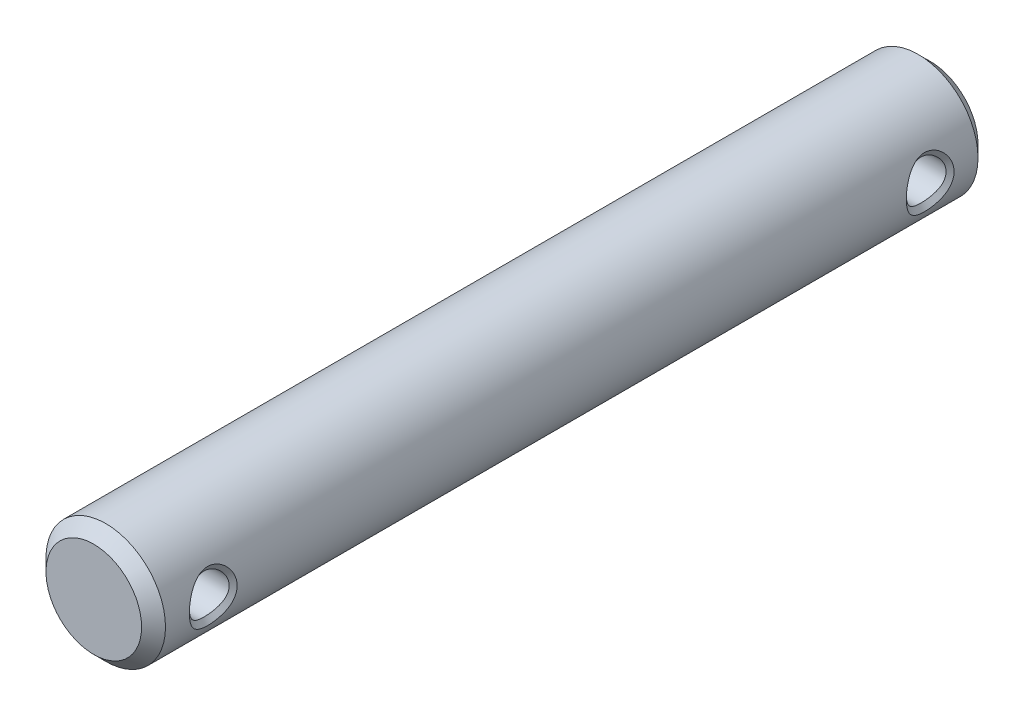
ISO-10303-21;
HEADER;
FILE_DESCRIPTION(('STEP AP214'),'2;1');
FILE_NAME('part.step','',(''),(''),'','','');
FILE_SCHEMA(('AUTOMOTIVE_DESIGN { 1 0 10303 214 1 1 1 1 }'));
ENDSEC;
DATA;
#1=APPLICATION_CONTEXT('core data for automotive mechanical design processes');
#2=APPLICATION_PROTOCOL_DEFINITION('international standard','automotive_design',2000,#1);
#3=PRODUCT_CONTEXT('',#1,'mechanical');
#4=PRODUCT('Part','Part','',(#3));
#5=PRODUCT_RELATED_PRODUCT_CATEGORY('part','',(#4));
#6=PRODUCT_DEFINITION_FORMATION('','',#4);
#7=PRODUCT_DEFINITION_CONTEXT('part definition',#1,'design');
#8=PRODUCT_DEFINITION('design','',#6,#7);
#9=PRODUCT_DEFINITION_SHAPE('','',#8);
#10=(LENGTH_UNIT() NAMED_UNIT(*) SI_UNIT(.MILLI.,.METRE.));
#11=(NAMED_UNIT(*) PLANE_ANGLE_UNIT() SI_UNIT($,.RADIAN.));
#12=(NAMED_UNIT(*) SI_UNIT($,.STERADIAN.) SOLID_ANGLE_UNIT());
#13=UNCERTAINTY_MEASURE_WITH_UNIT(LENGTH_MEASURE(1.E-05),#10,'distance_accuracy_value','');
#14=(GEOMETRIC_REPRESENTATION_CONTEXT(3) GLOBAL_UNCERTAINTY_ASSIGNED_CONTEXT((#13)) GLOBAL_UNIT_ASSIGNED_CONTEXT((#10,
#11,#12)) REPRESENTATION_CONTEXT('',''));
#15=CARTESIAN_POINT('',(0.,0.,0.));
#16=DIRECTION('',(0.,0.,1.));
#17=DIRECTION('',(1.,0.,0.));
#18=AXIS2_PLACEMENT_3D('',#15,#16,#17);
#19=CARTESIAN_POINT('',(0.,0.,210.));
#20=DIRECTION('',(0.,0.,-1.));
#21=DIRECTION('',(-1.,0.,0.));
#22=AXIS2_PLACEMENT_3D('',#19,#20,#21);
#23=CYLINDRICAL_SURFACE('',#22,15.);
#24=CARTESIAN_POINT('',(-15.,0.,200.999999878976));
#25=CARTESIAN_POINT('',(-14.9999632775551,0.10676641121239,200.999903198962));
#26=CARTESIAN_POINT('',(-14.9986589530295,0.213523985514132,200.997230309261));
#27=CARTESIAN_POINT('',(-14.9936382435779,0.426428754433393,200.986822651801));
#28=CARTESIAN_POINT('',(-14.9899287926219,0.532576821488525,200.979102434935));
#29=CARTESIAN_POINT('',(-14.9802303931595,0.74404667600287,200.958712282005));
#30=CARTESIAN_POINT('',(-14.9742466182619,0.849369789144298,200.946053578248));
#31=CARTESIAN_POINT('',(-14.9601337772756,1.0589785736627,200.915901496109));
#32=CARTESIAN_POINT('',(-14.952008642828,1.16326578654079,200.898416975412));
#33=CARTESIAN_POINT('',(-14.933746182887,1.3705906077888,200.858726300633));
#34=CARTESIAN_POINT('',(-14.9236119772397,1.47362989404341,200.836527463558));
#35=CARTESIAN_POINT('',(-14.9014642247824,1.67824704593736,200.787520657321));
#36=CARTESIAN_POINT('',(-14.8894533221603,1.77982675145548,200.76071916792));
#37=CARTESIAN_POINT('',(-14.8636846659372,1.98131277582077,200.702618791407));
#38=CARTESIAN_POINT('',(-14.8499293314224,2.08122119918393,200.671326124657));
#39=CARTESIAN_POINT('',(-14.820804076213,2.27915257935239,200.604354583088));
#40=CARTESIAN_POINT('',(-14.8054365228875,2.37717805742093,200.568682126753));
#41=CARTESIAN_POINT('',(-14.7732189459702,2.57113128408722,200.493061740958));
#42=CARTESIAN_POINT('',(-14.7563713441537,2.66706215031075,200.453120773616));
#43=CARTESIAN_POINT('',(-14.7213256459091,2.85661368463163,200.369073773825));
#44=CARTESIAN_POINT('',(-14.7031300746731,2.95023825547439,200.324975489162));
#45=CARTESIAN_POINT('',(-14.6655205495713,3.13496454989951,200.232723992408));
#46=CARTESIAN_POINT('',(-14.6461092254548,3.22607114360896,200.184579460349));
#47=CARTESIAN_POINT('',(-14.6061996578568,3.40554854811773,200.084345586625));
#48=CARTESIAN_POINT('',(-14.5857041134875,3.493925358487,200.032265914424));
#49=CARTESIAN_POINT('',(-14.5437600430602,3.66773043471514,199.924271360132));
#50=CARTESIAN_POINT('',(-14.5223142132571,3.75316595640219,199.868367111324));
#51=CARTESIAN_POINT('',(-14.4785945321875,3.92087428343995,199.752834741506));
#52=CARTESIAN_POINT('',(-14.4563233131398,4.00315568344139,199.693218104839));
#53=CARTESIAN_POINT('',(-14.4111115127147,4.16434626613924,199.570366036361));
#54=CARTESIAN_POINT('',(-14.3881732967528,4.24326538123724,199.507142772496));
#55=CARTESIAN_POINT('',(-14.3416614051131,4.3975042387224,199.377206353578));
#56=CARTESIAN_POINT('',(-14.3180901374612,4.47283523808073,199.310505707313));
#57=CARTESIAN_POINT('',(-14.2707993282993,4.6197687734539,199.173625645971));
#58=CARTESIAN_POINT('',(-14.2470804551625,4.69138194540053,199.1034574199));
#59=CARTESIAN_POINT('',(-14.2000200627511,4.83084773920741,198.959743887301));
#60=CARTESIAN_POINT('',(-14.1766777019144,4.89870993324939,198.886208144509));
#61=CARTESIAN_POINT('',(-14.1304423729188,5.03054029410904,198.735976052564));
#62=CARTESIAN_POINT('',(-14.1075483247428,5.09451888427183,198.659289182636));
#63=CARTESIAN_POINT('',(-14.062405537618,5.21846584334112,198.502947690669));
#64=CARTESIAN_POINT('',(-14.0401550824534,5.27844556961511,198.423302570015));
#65=CARTESIAN_POINT('',(-13.9964624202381,5.3942738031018,198.261243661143));
#66=CARTESIAN_POINT('',(-13.9750178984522,5.45013466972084,198.178839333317));
#67=CARTESIAN_POINT('',(-13.9331089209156,5.55760537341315,198.01145946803));
#68=CARTESIAN_POINT('',(-13.9126414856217,5.60922853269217,197.9264932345));
#69=CARTESIAN_POINT('',(-13.8728561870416,5.70810371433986,197.754187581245));
#70=CARTESIAN_POINT('',(-13.8535346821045,5.75536988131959,197.666857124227));
#71=CARTESIAN_POINT('',(-13.8162113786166,5.84541120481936,197.490021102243));
#72=CARTESIAN_POINT('',(-13.7982053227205,5.88820106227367,197.400523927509));
#73=CARTESIAN_POINT('',(-13.7636828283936,5.96917014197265,197.219552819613));
#74=CARTESIAN_POINT('',(-13.7471616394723,6.00736421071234,197.128086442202));
#75=CARTESIAN_POINT('',(-13.7157786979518,6.07902252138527,196.943375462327));
#76=CARTESIAN_POINT('',(-13.7009119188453,6.11250117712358,196.850137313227));
#77=CARTESIAN_POINT('',(-13.6730073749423,6.17461005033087,196.662081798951));
#78=CARTESIAN_POINT('',(-13.6599646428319,6.20325348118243,196.567269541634));
#79=CARTESIAN_POINT('',(-13.6358773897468,6.2555741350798,196.376264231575));
#80=CARTESIAN_POINT('',(-13.6248284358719,6.27926239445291,196.280074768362));
#81=CARTESIAN_POINT('',(-13.6048975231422,6.32155574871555,196.086516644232));
#82=CARTESIAN_POINT('',(-13.5960122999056,6.34016850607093,195.989149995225));
#83=CARTESIAN_POINT('',(-13.580576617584,6.37219583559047,195.793427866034));
#84=CARTESIAN_POINT('',(-13.5740248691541,6.38561327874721,195.695072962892));
#85=CARTESIAN_POINT('',(-13.5660759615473,6.40175063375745,195.547000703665));
#86=CARTESIAN_POINT('',(-13.5637391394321,6.40646554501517,195.497542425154));
#87=CARTESIAN_POINT('',(-13.5597117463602,6.41455325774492,195.398454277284));
#88=CARTESIAN_POINT('',(-13.5580216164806,6.41792514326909,195.348824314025));
#89=CARTESIAN_POINT('',(-13.5553084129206,6.42331257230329,195.249419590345));
#90=CARTESIAN_POINT('',(-13.5542860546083,6.42532666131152,195.199644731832));
#91=CARTESIAN_POINT('',(-13.5529303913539,6.42798213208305,195.099974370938));
#92=CARTESIAN_POINT('',(-13.5525981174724,6.42862145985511,195.050078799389));
#93=CARTESIAN_POINT('',(-13.5526391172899,6.4285210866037,194.950292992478));
#94=CARTESIAN_POINT('',(-13.5530123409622,6.42778148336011,194.900402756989));
#95=CARTESIAN_POINT('',(-13.5544415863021,6.42494090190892,194.800752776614));
#96=CARTESIAN_POINT('',(-13.5554964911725,6.42284215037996,194.750992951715));
#97=CARTESIAN_POINT('',(-13.5582691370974,6.41729617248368,194.651627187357));
#98=CARTESIAN_POINT('',(-13.559986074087,6.41385058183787,194.602021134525));
#99=CARTESIAN_POINT('',(-13.5640611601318,6.40562693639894,194.502988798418));
#100=CARTESIAN_POINT('',(-13.5664187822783,6.40084997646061,194.453562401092));
#101=CARTESIAN_POINT('',(-13.5744214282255,6.38454372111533,194.305606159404));
#102=CARTESIAN_POINT('',(-13.5809980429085,6.37103549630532,194.207336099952));
#103=CARTESIAN_POINT('',(-13.5964647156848,6.33886587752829,194.011805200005));
#104=CARTESIAN_POINT('',(-13.6053554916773,6.32020288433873,193.914544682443));
#105=CARTESIAN_POINT('',(-13.6252814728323,6.27784504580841,193.721213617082));
#106=CARTESIAN_POINT('',(-13.6363194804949,6.25414362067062,193.625144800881));
#107=CARTESIAN_POINT('',(-13.6603714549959,6.20182946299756,193.434388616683));
#108=CARTESIAN_POINT('',(-13.6733895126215,6.1732065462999,193.339704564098));
#109=CARTESIAN_POINT('',(-13.7012339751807,6.11116838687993,193.151906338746));
#110=CARTESIAN_POINT('',(-13.7160651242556,6.07774052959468,193.058797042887));
#111=CARTESIAN_POINT('',(-13.7473687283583,6.0062103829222,192.874337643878));
#112=CARTESIAN_POINT('',(-13.7638460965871,5.9680940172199,192.782993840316));
#113=CARTESIAN_POINT('',(-13.7982755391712,5.88730379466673,192.60225471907));
#114=CARTESIAN_POINT('',(-13.81623234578,5.84461517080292,192.512866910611));
#115=CARTESIAN_POINT('',(-13.8534544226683,5.75479664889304,192.336229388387));
#116=CARTESIAN_POINT('',(-13.8727240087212,5.70765188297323,192.248988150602));
#117=CARTESIAN_POINT('',(-13.9124054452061,5.60903669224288,192.076833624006));
#118=CARTESIAN_POINT('',(-13.9328210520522,5.55755172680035,191.991929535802));
#119=CARTESIAN_POINT('',(-13.9746290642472,5.45037149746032,191.824639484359));
#120=CARTESIAN_POINT('',(-13.9960245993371,5.3946623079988,191.742263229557));
#121=CARTESIAN_POINT('',(-14.0396247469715,5.27914816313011,191.580219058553));
#122=CARTESIAN_POINT('',(-14.0618318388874,5.21933006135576,191.500561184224));
#123=CARTESIAN_POINT('',(-14.1068960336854,5.09571456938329,191.344144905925));
#124=CARTESIAN_POINT('',(-14.1297550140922,5.03190488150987,191.267396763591));
#125=CARTESIAN_POINT('',(-14.1759314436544,4.90041477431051,191.116988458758));
#126=CARTESIAN_POINT('',(-14.1992501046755,4.83272285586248,191.043338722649));
#127=CARTESIAN_POINT('',(-14.2462759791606,4.69360637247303,190.899326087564));
#128=CARTESIAN_POINT('',(-14.2699841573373,4.62217109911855,190.828973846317));
#129=CARTESIAN_POINT('',(-14.3172693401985,4.47557565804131,190.691697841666));
#130=CARTESIAN_POINT('',(-14.3408456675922,4.40040413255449,190.62478597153));
#131=CARTESIAN_POINT('',(-14.3873809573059,4.24644352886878,190.494451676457));
#132=CARTESIAN_POINT('',(-14.4103375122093,4.1676428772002,190.43104207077));
#133=CARTESIAN_POINT('',(-14.4555959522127,4.00665869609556,190.307832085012));
#134=CARTESIAN_POINT('',(-14.4778954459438,3.92446492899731,190.248044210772));
#135=CARTESIAN_POINT('',(-14.521679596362,3.75689963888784,190.132187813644));
#136=CARTESIAN_POINT('',(-14.5431615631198,3.67151919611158,190.076131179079));
#137=CARTESIAN_POINT('',(-14.5851834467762,3.49779353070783,189.967850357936));
#138=CARTESIAN_POINT('',(-14.6057205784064,3.40944072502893,189.915637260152));
#139=CARTESIAN_POINT('',(-14.6457165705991,3.22998119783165,189.815156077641));
#140=CARTESIAN_POINT('',(-14.665172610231,3.13886814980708,189.766898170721));
#141=CARTESIAN_POINT('',(-14.7028725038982,2.9540996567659,189.674440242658));
#142=CARTESIAN_POINT('',(-14.7211135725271,2.86043901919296,189.630249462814));
#143=CARTESIAN_POINT('',(-14.7562488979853,2.67078683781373,189.546038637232));
#144=CARTESIAN_POINT('',(-14.7731404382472,2.57479107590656,189.506026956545));
#145=CARTESIAN_POINT('',(-14.8054422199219,2.38068033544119,189.430287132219));
#146=CARTESIAN_POINT('',(-14.8208498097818,2.28256193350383,189.394566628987));
#147=CARTESIAN_POINT('',(-14.8500491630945,2.08441776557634,189.327521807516));
#148=CARTESIAN_POINT('',(-14.8638382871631,1.98438918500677,189.296204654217));
#149=CARTESIAN_POINT('',(-14.8896662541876,1.78263669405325,189.238078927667));
#150=CARTESIAN_POINT('',(-14.9017023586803,1.68091040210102,189.21127739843));
#151=CARTESIAN_POINT('',(-14.9238899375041,1.47597468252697,189.162294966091));
#152=CARTESIAN_POINT('',(-14.9340383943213,1.37276315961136,189.14012145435));
#153=CARTESIAN_POINT('',(-14.9523165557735,1.16506932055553,189.100506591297));
#154=CARTESIAN_POINT('',(-14.9604427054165,1.06058510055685,189.083073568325));
#155=CARTESIAN_POINT('',(-14.9745422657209,0.85055823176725,189.053050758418));
#156=CARTESIAN_POINT('',(-14.9805112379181,0.745013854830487,189.040470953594));
#157=CARTESIAN_POINT('',(-14.9901633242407,0.533079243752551,189.020264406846));
#158=CARTESIAN_POINT('',(-14.9938406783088,0.426687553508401,189.012650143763));
#159=CARTESIAN_POINT('',(-14.9987749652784,0.213269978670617,189.002485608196));
#160=CARTESIAN_POINT('',(-15.0000242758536,0.106243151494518,188.999951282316));
#161=CARTESIAN_POINT('',(-14.9999756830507,-0.107808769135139,189.000049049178));
#162=CARTESIAN_POINT('',(-14.9986777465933,-0.214833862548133,189.002681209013));
#163=CARTESIAN_POINT('',(-14.9936570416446,-0.428245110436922,189.013029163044));
#164=CARTESIAN_POINT('',(-14.9899418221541,-0.534632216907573,189.0207291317));
#165=CARTESIAN_POINT('',(-14.9802212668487,-0.746554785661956,189.041097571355));
#166=CARTESIAN_POINT('',(-14.9742216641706,-0.852091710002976,189.053753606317));
#167=CARTESIAN_POINT('',(-14.9600683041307,-1.06210085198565,189.083918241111));
#168=CARTESIAN_POINT('',(-14.9519189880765,-1.16657480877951,189.101416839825));
#169=CARTESIAN_POINT('',(-14.933601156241,-1.37424532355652,189.141152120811));
#170=CARTESIAN_POINT('',(-14.9234362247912,-1.47744380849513,189.163380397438));
#171=CARTESIAN_POINT('',(-14.9012218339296,-1.68235067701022,189.212461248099));
#172=CARTESIAN_POINT('',(-14.8891754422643,-1.78406119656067,189.239306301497));
#173=CARTESIAN_POINT('',(-14.8633324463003,-1.98577938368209,189.297507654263));
#174=CARTESIAN_POINT('',(-14.8495386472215,-2.085789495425,189.328856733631));
#175=CARTESIAN_POINT('',(-14.8203349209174,-2.28389397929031,189.395953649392));
#176=CARTESIAN_POINT('',(-14.804927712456,-2.38199125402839,189.431694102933));
#177=CARTESIAN_POINT('',(-14.7726311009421,-2.57605700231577,189.507461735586));
#178=CARTESIAN_POINT('',(-14.7557444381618,-2.67202901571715,189.547481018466));
#179=CARTESIAN_POINT('',(-14.7206227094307,-2.8616309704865,189.631694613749));
#180=CARTESIAN_POINT('',(-14.7023904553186,-2.95526527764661,189.675880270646));
#181=CARTESIAN_POINT('',(-14.6647114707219,-3.13997837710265,189.76831518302));
#182=CARTESIAN_POINT('',(-14.6452676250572,-3.23106254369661,189.816554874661));
#183=CARTESIAN_POINT('',(-14.6052987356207,-3.41046160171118,189.91698648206));
#184=CARTESIAN_POINT('',(-14.5847766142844,-3.49878303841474,189.969167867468));
#185=CARTESIAN_POINT('',(-14.5427869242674,-3.67244316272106,190.077371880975));
#186=CARTESIAN_POINT('',(-14.5213222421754,-3.75778969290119,190.133383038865));
#187=CARTESIAN_POINT('',(-14.4775742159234,-3.92528470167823,190.249134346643));
#188=CARTESIAN_POINT('',(-14.4552936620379,-4.00744240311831,190.30886220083));
#189=CARTESIAN_POINT('',(-14.4100743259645,-4.168350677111,190.431939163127));
#190=CARTESIAN_POINT('',(-14.3871380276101,-4.24711184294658,190.495275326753));
#191=CARTESIAN_POINT('',(-14.3406431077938,-4.40099455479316,190.625443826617));
#192=CARTESIAN_POINT('',(-14.3170869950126,-4.47612806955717,190.692262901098));
#193=CARTESIAN_POINT('',(-14.2698336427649,-4.6226641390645,190.829386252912));
#194=CARTESIAN_POINT('',(-14.2461370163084,-4.69407694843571,190.899679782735));
#195=CARTESIAN_POINT('',(-14.1991198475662,-4.83317888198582,191.043648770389));
#196=CARTESIAN_POINT('',(-14.1757985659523,-4.90087618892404,191.117316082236));
#197=CARTESIAN_POINT('',(-14.129604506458,-5.03240586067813,191.267818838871));
#198=CARTESIAN_POINT('',(-14.1067307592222,-5.0962473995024,191.344645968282));
#199=CARTESIAN_POINT('',(-14.0616277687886,-5.21994741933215,191.50127188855));
#200=CARTESIAN_POINT('',(-14.0393969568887,-5.27981615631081,191.581062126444));
#201=CARTESIAN_POINT('',(-13.9957429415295,-5.39544606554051,191.743413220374));
#202=CARTESIAN_POINT('',(-13.9743175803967,-5.45121866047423,191.825965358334));
#203=CARTESIAN_POINT('',(-13.9324464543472,-5.55853337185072,191.993640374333));
#204=CARTESIAN_POINT('',(-13.9119978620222,-5.6100880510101,192.078754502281));
#205=CARTESIAN_POINT('',(-13.872249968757,-5.70884359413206,192.251353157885));
#206=CARTESIAN_POINT('',(-13.8529471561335,-5.75605803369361,192.338829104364));
#207=CARTESIAN_POINT('',(-13.8156611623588,-5.84601001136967,192.515950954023));
#208=CARTESIAN_POINT('',(-13.797673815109,-5.88876188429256,192.605588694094));
#209=CARTESIAN_POINT('',(-13.7631888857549,-5.96966587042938,192.78683340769));
#210=CARTESIAN_POINT('',(-13.7466865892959,-6.00783267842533,192.878432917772));
#211=CARTESIAN_POINT('',(-13.7153418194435,-6.0794441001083,193.063400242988));
#212=CARTESIAN_POINT('',(-13.7004942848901,-6.11290319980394,193.156761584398));
#213=CARTESIAN_POINT('',(-13.6726288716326,-6.17497734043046,193.345051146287));
#214=CARTESIAN_POINT('',(-13.6596059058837,-6.20360589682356,193.439974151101));
#215=CARTESIAN_POINT('',(-13.6355590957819,-6.25589792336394,193.631186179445));
#216=CARTESIAN_POINT('',(-13.6245306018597,-6.27957296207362,193.727471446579));
#217=CARTESIAN_POINT('',(-13.6046417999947,-6.32183773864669,193.921203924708));
#218=CARTESIAN_POINT('',(-13.5957779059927,-6.34043589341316,194.018648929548));
#219=CARTESIAN_POINT('',(-13.5803863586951,-6.37242863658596,194.214508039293));
#220=CARTESIAN_POINT('',(-13.5738569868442,-6.38582705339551,194.312921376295));
#221=CARTESIAN_POINT('',(-13.5659425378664,-6.40193028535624,194.461072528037));
#222=CARTESIAN_POINT('',(-13.5636174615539,-6.40663267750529,194.510551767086));
#223=CARTESIAN_POINT('',(-13.5596139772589,-6.41469292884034,194.609675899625));
#224=CARTESIAN_POINT('',(-13.5579359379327,-6.41805002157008,194.659320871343));
#225=CARTESIAN_POINT('',(-13.5552473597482,-6.42340506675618,194.758749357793));
#226=CARTESIAN_POINT('',(-13.5542374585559,-6.42540172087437,194.80853295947));
#227=CARTESIAN_POINT('',(-13.5529071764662,-6.42801910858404,194.908214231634));
#228=CARTESIAN_POINT('',(-13.552587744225,-6.42863794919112,194.958111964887));
#229=CARTESIAN_POINT('',(-13.5526549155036,-6.42849316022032,195.057895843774));
#230=CARTESIAN_POINT('',(-13.5530413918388,-6.42772977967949,195.107781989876));
#231=CARTESIAN_POINT('',(-13.5544975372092,-6.42483866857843,195.207418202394));
#232=CARTESIAN_POINT('',(-13.5555660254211,-6.4227132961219,195.257168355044));
#233=CARTESIAN_POINT('',(-13.5583661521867,-6.41711136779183,195.356509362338));
#234=CARTESIAN_POINT('',(-13.5600969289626,-6.41363656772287,195.406100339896));
#235=CARTESIAN_POINT('',(-13.5641999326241,-6.40535210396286,195.505097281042));
#236=CARTESIAN_POINT('',(-13.5665715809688,-6.40054364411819,195.55450337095));
#237=CARTESIAN_POINT('',(-13.5746162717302,-6.38414030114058,195.70238592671));
#238=CARTESIAN_POINT('',(-13.5812211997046,-6.37056325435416,195.800600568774));
#239=CARTESIAN_POINT('',(-13.5967447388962,-6.33824953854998,195.996001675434));
#240=CARTESIAN_POINT('',(-13.6056637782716,-6.31951191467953,196.093187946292));
#241=CARTESIAN_POINT('',(-13.6256459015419,-6.27700077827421,196.286353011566));
#242=CARTESIAN_POINT('',(-13.6367115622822,-6.2532212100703,196.382330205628));
#243=CARTESIAN_POINT('',(-13.6608178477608,-6.20074912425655,196.572887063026));
#244=CARTESIAN_POINT('',(-13.6738623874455,-6.17204685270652,196.667463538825));
#245=CARTESIAN_POINT('',(-13.7017582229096,-6.1098507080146,196.85503196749));
#246=CARTESIAN_POINT('',(-13.7166141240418,-6.07634458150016,196.948019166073));
#247=CARTESIAN_POINT('',(-13.7479650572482,-6.00466096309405,197.132221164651));
#248=CARTESIAN_POINT('',(-13.7644648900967,-5.96646970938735,197.223429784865));
#249=CARTESIAN_POINT('',(-13.798936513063,-5.88553509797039,197.403886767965));
#250=CARTESIAN_POINT('',(-13.8169129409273,-5.84277726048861,197.49312774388));
#251=CARTESIAN_POINT('',(-13.8541709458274,-5.75282800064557,197.669461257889));
#252=CARTESIAN_POINT('',(-13.8734567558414,-5.70562198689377,197.756545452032));
#253=CARTESIAN_POINT('',(-13.9131667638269,-5.60689427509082,197.928376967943));
#254=CARTESIAN_POINT('',(-13.9335946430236,-5.55535831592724,198.013115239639));
#255=CARTESIAN_POINT('',(-13.9754227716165,-5.4480883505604,198.180066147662));
#256=CARTESIAN_POINT('',(-13.9968260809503,-5.39234071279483,198.262269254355));
#257=CARTESIAN_POINT('',(-14.0404367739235,-5.27676417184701,198.423961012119));
#258=CARTESIAN_POINT('',(-14.0626465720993,-5.21692244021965,198.503439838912));
#259=CARTESIAN_POINT('',(-14.1077106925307,-5.09327649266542,198.659493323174));
#260=CARTESIAN_POINT('',(-14.1305668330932,-5.02946032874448,198.736057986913));
#261=CARTESIAN_POINT('',(-14.1767312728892,-4.89797613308,198.886095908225));
#262=CARTESIAN_POINT('',(-14.2000407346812,-4.83029699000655,198.959559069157));
#263=CARTESIAN_POINT('',(-14.2470423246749,-4.69122785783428,199.103196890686));
#264=CARTESIAN_POINT('',(-14.2707353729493,-4.61982759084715,199.173361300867));
#265=CARTESIAN_POINT('',(-14.3179867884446,-4.47330321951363,199.31027884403));
#266=CARTESIAN_POINT('',(-14.3415444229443,-4.39816726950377,199.377019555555));
#267=CARTESIAN_POINT('',(-14.3880424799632,-4.24426123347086,199.507045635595));
#268=CARTESIAN_POINT('',(-14.41098019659,-4.16547834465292,199.570316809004));
#269=CARTESIAN_POINT('',(-14.4562020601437,-4.004518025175,199.693280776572));
#270=CARTESIAN_POINT('',(-14.4784835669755,-3.92232942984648,199.752959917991));
#271=CARTESIAN_POINT('',(-14.5222325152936,-3.75476690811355,199.868625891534));
#272=CARTESIAN_POINT('',(-14.5436970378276,-3.66938339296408,199.924599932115));
#273=CARTESIAN_POINT('',(-14.5856848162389,-3.49564836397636,200.032738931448));
#274=CARTESIAN_POINT('',(-14.6062051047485,-3.40728882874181,200.084892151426));
#275=CARTESIAN_POINT('',(-14.6461680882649,-3.22781694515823,200.185273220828));
#276=CARTESIAN_POINT('',(-14.6656078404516,-3.13669803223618,200.233490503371));
#277=CARTESIAN_POINT('',(-14.7032757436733,-2.95192328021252,200.325883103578));
#278=CARTESIAN_POINT('',(-14.7215010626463,-2.85826218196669,200.370049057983));
#279=CARTESIAN_POINT('',(-14.7566053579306,-2.66861894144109,200.454222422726));
#280=CARTESIAN_POINT('',(-14.7734816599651,-2.57263265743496,200.494221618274));
#281=CARTESIAN_POINT('',(-14.8057533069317,-2.37855515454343,200.569944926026));
#282=CARTESIAN_POINT('',(-14.8211461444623,-2.28046070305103,200.605661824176));
#283=CARTESIAN_POINT('',(-14.8503161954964,-2.08238316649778,200.672704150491));
#284=CARTESIAN_POINT('',(-14.8640910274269,-1.98239754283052,200.704023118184));
#285=CARTESIAN_POINT('',(-14.8898904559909,-1.78075416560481,200.762153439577));
#286=CARTESIAN_POINT('',(-14.9019126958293,-1.67909436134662,200.78895873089));
#287=CARTESIAN_POINT('',(-14.9240724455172,-1.47431934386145,200.837945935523));
#288=CARTESIAN_POINT('',(-14.9342074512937,-1.37120238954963,200.860121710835));
#289=CARTESIAN_POINT('',(-14.9524583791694,-1.16372986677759,200.899734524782));
#290=CARTESIAN_POINT('',(-14.9605713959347,-1.05937273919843,200.917164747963));
#291=CARTESIAN_POINT('',(-14.9746444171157,-0.849637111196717,200.947171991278));
#292=CARTESIAN_POINT('',(-14.9806007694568,-0.744257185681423,200.959740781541));
#293=CARTESIAN_POINT('',(-14.990226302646,-0.532691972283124,200.979910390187));
#294=CARTESIAN_POINT('',(-14.9938906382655,-0.42650545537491,200.987500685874));
#295=CARTESIAN_POINT('',(-14.9988006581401,-0.213547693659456,200.997603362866));
#296=CARTESIAN_POINT('',(-15.0000397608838,-0.106775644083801,201.000101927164));
#297=CARTESIAN_POINT('',(-15.,0.,200.999999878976));
#298=B_SPLINE_CURVE_WITH_KNOTS('',3,(#24,#25,#26,#27,#28,#29,#30,#31,#32,#33,#34,#35,#36,#37,
#38,#39,#40,#41,#42,#43,#44,#45,#46,#47,#48,#49,#50,#51,#52,#53,#54,#55,#56,#57,#58,#59,#60,#61,
#62,#63,#64,#65,#66,#67,#68,#69,#70,#71,#72,#73,#74,#75,#76,#77,#78,#79,#80,#81,#82,#83,#84,#85,
#86,#87,#88,#89,#90,#91,#92,#93,#94,#95,#96,#97,#98,#99,#100,#101,#102,#103,#104,#105,#106,#107,
#108,#109,#110,#111,#112,#113,#114,#115,#116,#117,#118,#119,#120,#121,#122,#123,#124,#125,#126,
#127,#128,#129,#130,#131,#132,#133,#134,#135,#136,#137,#138,#139,#140,#141,#142,#143,#144,#145,
#146,#147,#148,#149,#150,#151,#152,#153,#154,#155,#156,#157,#158,#159,#160,#161,#162,#163,#164,
#165,#166,#167,#168,#169,#170,#171,#172,#173,#174,#175,#176,#177,#178,#179,#180,#181,#182,#183,
#184,#185,#186,#187,#188,#189,#190,#191,#192,#193,#194,#195,#196,#197,#198,#199,#200,#201,#202,
#203,#204,#205,#206,#207,#208,#209,#210,#211,#212,#213,#214,#215,#216,#217,#218,#219,#220,#221,
#222,#223,#224,#225,#226,#227,#228,#229,#230,#231,#232,#233,#234,#235,#236,#237,#238,#239,#240,
#241,#242,#243,#244,#245,#246,#247,#248,#249,#250,#251,#252,#253,#254,#255,#256,#257,#258,#259,
#260,#261,#262,#263,#264,#265,#266,#267,#268,#269,#270,#271,#272,#273,#274,#275,#276,#277,#278,
#279,#280,#281,#282,#283,#284,#285,#286,#287,#288,#289,#290,#291,#292,#293,#294,#295,#296,#297),
.UNSPECIFIED.,.F.,.F.,(4,2,2,2,2,2,2,2,2,2,2,2,2,2,2,2,2,2,2,2,2,2,2,2,2,2,2,2,2,2,2,2,2,2,2,2,
2,2,2,2,2,2,2,2,2,2,2,2,2,2,2,2,2,2,2,2,2,2,2,2,2,2,2,2,2,2,2,2,2,2,2,2,2,2,2,2,2,2,2,2,2,2,2,2,
2,2,2,2,2,2,2,2,2,2,2,2,2,2,2,2,2,2,2,2,2,2,2,2,2,2,2,2,2,2,2,2,2,2,2,2,2,2,2,2,2,2,2,2,2,2,2,2,
2,2,2,2,4),(0.,0.32025203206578,0.639584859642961,0.958195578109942,1.27622533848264,
1.59376505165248,1.91086133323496,2.22752259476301,2.54372521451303,2.85941974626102,
3.17453714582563,3.48899501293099,3.80270385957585,4.11557342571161,4.42751906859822,
4.7384682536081,5.04836717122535,5.35732422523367,5.66545251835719,5.97271348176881,
6.27906091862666,6.58444815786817,6.88883531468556,7.19219667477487,7.49452821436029,
7.79585525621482,8.09624024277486,8.3957905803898,8.69466647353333,8.99308862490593,
9.29134562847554,9.44053939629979,9.58983474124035,9.73928976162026,9.88896792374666,
10.0386354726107,10.1880584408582,10.3373004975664,10.4864201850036,10.7844699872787,
11.0826123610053,11.3811465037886,11.680306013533,11.9802657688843,12.281149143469,
12.5830353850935,12.8859670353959,13.1899573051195,13.4949973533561,13.8010634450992,
14.108123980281,14.4161463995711,14.7251039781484,15.0350662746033,15.346096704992,
15.658146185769,15.971146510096,16.2850170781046,16.5996714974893,16.9150240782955,
17.2309962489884,17.5475229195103,17.8645588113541,18.1820847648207,18.5001140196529,
18.8186984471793,19.1379346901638,19.4579701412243,19.7790086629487,20.1000513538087,
20.4200962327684,20.739343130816,21.0579355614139,21.3759664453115,21.693484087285,
22.0104983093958,22.3269866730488,22.6429007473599,22.9581724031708,23.2727201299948,
23.5864553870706,23.8992890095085,24.2111376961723,24.5219306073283,24.8316160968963,
25.1403972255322,25.4484685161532,25.7557753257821,26.0622551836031,26.3678450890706,
26.6724889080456,26.9761448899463,27.2787933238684,27.5804443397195,27.8811458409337,
28.1809915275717,28.4801289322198,28.7787673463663,29.077185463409,29.2264365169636,
29.3757724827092,29.5252507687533,29.6749342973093,29.8245908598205,29.9739890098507,
30.1231934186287,30.2722635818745,30.5701821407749,30.8681558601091,31.1664895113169,
31.4654212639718,31.7651295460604,32.0657402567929,32.3673341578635,32.6699543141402,
32.9736134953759,33.2783014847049,33.5839922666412,33.89065108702,34.1982413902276,
34.5067316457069,34.8162717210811,35.1269959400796,35.4388349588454,35.751699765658,
36.0654886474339,36.3800940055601,36.6954090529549,37.0113344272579,37.3277847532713,
37.6446951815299,37.9620279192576,38.2797787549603,38.5979835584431,38.9167247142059,
39.2361374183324,39.5564157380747),.UNSPECIFIED.);
#299=CARTESIAN_POINT('',(-15.,0.,200.999999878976));
#300=VERTEX_POINT('',#299);
#301=EDGE_CURVE('E56',#300,#300,#298,.F.);
#302=ORIENTED_EDGE('',*,*,#301,.T.);
#303=EDGE_LOOP('',(#302));
#304=FACE_BOUND('',#303,.T.);
#305=CARTESIAN_POINT('',(15.,0.,189.000000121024));
#306=CARTESIAN_POINT('',(14.9999632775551,0.106766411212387,189.000096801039));
#307=CARTESIAN_POINT('',(14.9986589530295,0.213523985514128,189.002769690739));
#308=CARTESIAN_POINT('',(14.9936382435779,0.426428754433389,189.013177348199));
#309=CARTESIAN_POINT('',(14.9899287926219,0.532576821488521,189.020897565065));
#310=CARTESIAN_POINT('',(14.9802303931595,0.744046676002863,189.041287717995));
#311=CARTESIAN_POINT('',(14.9742466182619,0.849369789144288,189.053946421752));
#312=CARTESIAN_POINT('',(14.9601337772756,1.05897857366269,189.084098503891));
#313=CARTESIAN_POINT('',(14.952008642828,1.16326578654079,189.101583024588));
#314=CARTESIAN_POINT('',(14.933746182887,1.3705906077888,189.141273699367));
#315=CARTESIAN_POINT('',(14.9236119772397,1.4736298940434,189.163472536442));
#316=CARTESIAN_POINT('',(14.9014642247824,1.67824704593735,189.212479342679));
#317=CARTESIAN_POINT('',(14.8894533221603,1.77982675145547,189.23928083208));
#318=CARTESIAN_POINT('',(14.8636846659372,1.98131277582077,189.297381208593));
#319=CARTESIAN_POINT('',(14.8499293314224,2.08122119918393,189.328673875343));
#320=CARTESIAN_POINT('',(14.820804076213,2.27915257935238,189.395645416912));
#321=CARTESIAN_POINT('',(14.8054365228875,2.37717805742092,189.431317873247));
#322=CARTESIAN_POINT('',(14.7732189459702,2.57113128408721,189.506938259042));
#323=CARTESIAN_POINT('',(14.7563713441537,2.66706215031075,189.546879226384));
#324=CARTESIAN_POINT('',(14.7213256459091,2.85661368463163,189.630926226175));
#325=CARTESIAN_POINT('',(14.7031300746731,2.95023825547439,189.675024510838));
#326=CARTESIAN_POINT('',(14.6655205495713,3.1349645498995,189.767276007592));
#327=CARTESIAN_POINT('',(14.6461092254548,3.22607114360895,189.815420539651));
#328=CARTESIAN_POINT('',(14.6061996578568,3.40554854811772,189.915654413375));
#329=CARTESIAN_POINT('',(14.5857041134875,3.49392535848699,189.967734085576));
#330=CARTESIAN_POINT('',(14.5437600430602,3.66773043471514,190.075728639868));
#331=CARTESIAN_POINT('',(14.5223142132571,3.75316595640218,190.131632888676));
#332=CARTESIAN_POINT('',(14.4785945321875,3.92087428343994,190.247165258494));
#333=CARTESIAN_POINT('',(14.4563233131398,4.00315568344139,190.306781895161));
#334=CARTESIAN_POINT('',(14.4111115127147,4.16434626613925,190.429633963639));
#335=CARTESIAN_POINT('',(14.3881732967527,4.24326538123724,190.492857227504));
#336=CARTESIAN_POINT('',(14.3416614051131,4.3975042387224,190.622793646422));
#337=CARTESIAN_POINT('',(14.3180901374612,4.47283523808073,190.689494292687));
#338=CARTESIAN_POINT('',(14.2707993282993,4.6197687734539,190.826374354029));
#339=CARTESIAN_POINT('',(14.2470804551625,4.69138194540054,190.8965425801));
#340=CARTESIAN_POINT('',(14.200020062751,4.83084773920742,191.040256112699));
#341=CARTESIAN_POINT('',(14.1766777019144,4.89870993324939,191.113791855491));
#342=CARTESIAN_POINT('',(14.1304423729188,5.03054029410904,191.264023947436));
#343=CARTESIAN_POINT('',(14.1075483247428,5.09451888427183,191.340710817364));
#344=CARTESIAN_POINT('',(14.062405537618,5.21846584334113,191.497052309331));
#345=CARTESIAN_POINT('',(14.0401550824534,5.27844556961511,191.576697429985));
#346=CARTESIAN_POINT('',(13.9964624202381,5.39427380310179,191.738756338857));
#347=CARTESIAN_POINT('',(13.9750178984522,5.45013466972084,191.821160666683));
#348=CARTESIAN_POINT('',(13.9331089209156,5.55760537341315,191.98854053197));
#349=CARTESIAN_POINT('',(13.9126414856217,5.60922853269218,192.0735067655));
#350=CARTESIAN_POINT('',(13.8728561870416,5.70810371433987,192.245812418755));
#351=CARTESIAN_POINT('',(13.8535346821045,5.7553698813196,192.333142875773));
#352=CARTESIAN_POINT('',(13.8162113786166,5.84541120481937,192.509978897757));
#353=CARTESIAN_POINT('',(13.7982053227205,5.88820106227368,192.599476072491));
#354=CARTESIAN_POINT('',(13.7636828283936,5.96917014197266,192.780447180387));
#355=CARTESIAN_POINT('',(13.7471616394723,6.00736421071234,192.871913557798));
#356=CARTESIAN_POINT('',(13.7157786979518,6.07902252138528,193.056624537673));
#357=CARTESIAN_POINT('',(13.7009119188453,6.11250117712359,193.149862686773));
#358=CARTESIAN_POINT('',(13.6730073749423,6.17461005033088,193.337918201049));
#359=CARTESIAN_POINT('',(13.6599646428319,6.20325348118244,193.432730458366));
#360=CARTESIAN_POINT('',(13.6358773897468,6.2555741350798,193.623735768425));
#361=CARTESIAN_POINT('',(13.6248284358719,6.27926239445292,193.719925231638));
#362=CARTESIAN_POINT('',(13.6048975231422,6.32155574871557,193.913483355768));
#363=CARTESIAN_POINT('',(13.5960122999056,6.34016850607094,194.010850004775));
#364=CARTESIAN_POINT('',(13.580576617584,6.37219583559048,194.206572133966));
#365=CARTESIAN_POINT('',(13.5740248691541,6.38561327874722,194.304927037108));
#366=CARTESIAN_POINT('',(13.5660759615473,6.40175063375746,194.452999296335));
#367=CARTESIAN_POINT('',(13.5637391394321,6.40646554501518,194.502457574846));
#368=CARTESIAN_POINT('',(13.5597117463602,6.41455325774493,194.601545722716));
#369=CARTESIAN_POINT('',(13.5580216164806,6.4179251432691,194.651175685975));
#370=CARTESIAN_POINT('',(13.5553084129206,6.4233125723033,194.750580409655));
#371=CARTESIAN_POINT('',(13.5542860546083,6.42532666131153,194.800355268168));
#372=CARTESIAN_POINT('',(13.5529303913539,6.42798213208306,194.900025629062));
#373=CARTESIAN_POINT('',(13.5525981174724,6.42862145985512,194.949921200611));
#374=CARTESIAN_POINT('',(13.5526391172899,6.4285210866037,195.049707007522));
#375=CARTESIAN_POINT('',(13.5530123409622,6.42778148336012,195.099597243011));
#376=CARTESIAN_POINT('',(13.5544415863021,6.42494090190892,195.199247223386));
#377=CARTESIAN_POINT('',(13.5554964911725,6.42284215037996,195.249007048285));
#378=CARTESIAN_POINT('',(13.5582691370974,6.41729617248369,195.348372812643));
#379=CARTESIAN_POINT('',(13.559986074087,6.41385058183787,195.397978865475));
#380=CARTESIAN_POINT('',(13.5640611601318,6.40562693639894,195.497011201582));
#381=CARTESIAN_POINT('',(13.5664187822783,6.40084997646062,195.546437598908));
#382=CARTESIAN_POINT('',(13.5744214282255,6.38454372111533,195.694393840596));
#383=CARTESIAN_POINT('',(13.5809980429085,6.37103549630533,195.792663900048));
#384=CARTESIAN_POINT('',(13.5964647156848,6.33886587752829,195.988194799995));
#385=CARTESIAN_POINT('',(13.6053554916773,6.32020288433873,196.085455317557));
#386=CARTESIAN_POINT('',(13.6252814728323,6.27784504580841,196.278786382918));
#387=CARTESIAN_POINT('',(13.6363194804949,6.25414362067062,196.374855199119));
#388=CARTESIAN_POINT('',(13.6603714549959,6.20182946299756,196.565611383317));
#389=CARTESIAN_POINT('',(13.6733895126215,6.17320654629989,196.660295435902));
#390=CARTESIAN_POINT('',(13.7012339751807,6.11116838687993,196.848093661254));
#391=CARTESIAN_POINT('',(13.7160651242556,6.07774052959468,196.941202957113));
#392=CARTESIAN_POINT('',(13.7473687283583,6.00621038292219,197.125662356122));
#393=CARTESIAN_POINT('',(13.7638460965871,5.96809401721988,197.217006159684));
#394=CARTESIAN_POINT('',(13.7982755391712,5.88730379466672,197.39774528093));
#395=CARTESIAN_POINT('',(13.8162323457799,5.84461517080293,197.487133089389));
#396=CARTESIAN_POINT('',(13.8534544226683,5.75479664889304,197.663770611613));
#397=CARTESIAN_POINT('',(13.8727240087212,5.70765188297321,197.751011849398));
#398=CARTESIAN_POINT('',(13.9124054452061,5.60903669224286,197.923166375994));
#399=CARTESIAN_POINT('',(13.9328210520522,5.55755172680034,198.008070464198));
#400=CARTESIAN_POINT('',(13.9746290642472,5.45037149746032,198.175360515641));
#401=CARTESIAN_POINT('',(13.9960245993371,5.39466230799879,198.257736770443));
#402=CARTESIAN_POINT('',(14.0396247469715,5.27914816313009,198.419780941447));
#403=CARTESIAN_POINT('',(14.0618318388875,5.21933006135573,198.499438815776));
#404=CARTESIAN_POINT('',(14.1068960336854,5.09571456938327,198.655855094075));
#405=CARTESIAN_POINT('',(14.1297550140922,5.03190488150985,198.732603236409));
#406=CARTESIAN_POINT('',(14.1759314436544,4.9004147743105,198.883011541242));
#407=CARTESIAN_POINT('',(14.1992501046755,4.83272285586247,198.956661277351));
#408=CARTESIAN_POINT('',(14.2462759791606,4.69360637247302,199.100673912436));
#409=CARTESIAN_POINT('',(14.2699841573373,4.62217109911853,199.171026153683));
#410=CARTESIAN_POINT('',(14.3172693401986,4.47557565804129,199.308302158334));
#411=CARTESIAN_POINT('',(14.3408456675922,4.40040413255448,199.37521402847));
#412=CARTESIAN_POINT('',(14.3873809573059,4.24644352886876,199.505548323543));
#413=CARTESIAN_POINT('',(14.4103375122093,4.16764287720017,199.56895792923));
#414=CARTESIAN_POINT('',(14.4555959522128,4.00665869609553,199.692167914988));
#415=CARTESIAN_POINT('',(14.4778954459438,3.92446492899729,199.751955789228));
#416=CARTESIAN_POINT('',(14.5216795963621,3.75689963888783,199.867812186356));
#417=CARTESIAN_POINT('',(14.5431615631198,3.67151919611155,199.923868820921));
#418=CARTESIAN_POINT('',(14.5851834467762,3.49779353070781,200.032149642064));
#419=CARTESIAN_POINT('',(14.6057205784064,3.40944072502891,200.084362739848));
#420=CARTESIAN_POINT('',(14.6457165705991,3.22998119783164,200.184843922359));
#421=CARTESIAN_POINT('',(14.665172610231,3.13886814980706,200.233101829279));
#422=CARTESIAN_POINT('',(14.7028725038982,2.95409965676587,200.325559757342));
#423=CARTESIAN_POINT('',(14.7211135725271,2.86043901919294,200.369750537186));
#424=CARTESIAN_POINT('',(14.7562488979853,2.67078683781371,200.453961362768));
#425=CARTESIAN_POINT('',(14.7731404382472,2.57479107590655,200.493973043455));
#426=CARTESIAN_POINT('',(14.805442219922,2.38068033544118,200.569712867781));
#427=CARTESIAN_POINT('',(14.8208498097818,2.28256193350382,200.605433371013));
#428=CARTESIAN_POINT('',(14.8500491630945,2.08441776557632,200.672478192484));
#429=CARTESIAN_POINT('',(14.8638382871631,1.98438918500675,200.703795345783));
#430=CARTESIAN_POINT('',(14.8896662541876,1.78263669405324,200.761921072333));
#431=CARTESIAN_POINT('',(14.9017023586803,1.680910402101,200.78872260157));
#432=CARTESIAN_POINT('',(14.9238899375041,1.47597468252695,200.837705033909));
#433=CARTESIAN_POINT('',(14.9340383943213,1.37276315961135,200.85987854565));
#434=CARTESIAN_POINT('',(14.9523165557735,1.16506932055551,200.899493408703));
#435=CARTESIAN_POINT('',(14.9604427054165,1.06058510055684,200.916926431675));
#436=CARTESIAN_POINT('',(14.9745422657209,0.850558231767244,200.946949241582));
#437=CARTESIAN_POINT('',(14.9805112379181,0.74501385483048,200.959529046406));
#438=CARTESIAN_POINT('',(14.9901633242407,0.533079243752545,200.979735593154));
#439=CARTESIAN_POINT('',(14.9938406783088,0.426687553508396,200.987349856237));
#440=CARTESIAN_POINT('',(14.9987749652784,0.213269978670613,200.997514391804));
#441=CARTESIAN_POINT('',(15.0000242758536,0.106243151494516,201.000048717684));
#442=CARTESIAN_POINT('',(14.9999756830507,-0.107808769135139,200.999950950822));
#443=CARTESIAN_POINT('',(14.9986777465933,-0.214833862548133,200.997318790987));
#444=CARTESIAN_POINT('',(14.9936570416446,-0.42824511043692,200.986970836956));
#445=CARTESIAN_POINT('',(14.9899418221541,-0.534632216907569,200.9792708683));
#446=CARTESIAN_POINT('',(14.9802212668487,-0.746554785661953,200.958902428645));
#447=CARTESIAN_POINT('',(14.9742216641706,-0.852091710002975,200.946246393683));
#448=CARTESIAN_POINT('',(14.9600683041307,-1.06210085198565,200.916081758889));
#449=CARTESIAN_POINT('',(14.9519189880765,-1.16657480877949,200.898583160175));
#450=CARTESIAN_POINT('',(14.933601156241,-1.37424532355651,200.858847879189));
#451=CARTESIAN_POINT('',(14.9234362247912,-1.47744380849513,200.836619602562));
#452=CARTESIAN_POINT('',(14.9012218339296,-1.68235067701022,200.787538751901));
#453=CARTESIAN_POINT('',(14.8891754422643,-1.78406119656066,200.760693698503));
#454=CARTESIAN_POINT('',(14.8633324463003,-1.98577938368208,200.702492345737));
#455=CARTESIAN_POINT('',(14.8495386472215,-2.08578949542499,200.671143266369));
#456=CARTESIAN_POINT('',(14.8203349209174,-2.28389397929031,200.604046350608));
#457=CARTESIAN_POINT('',(14.804927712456,-2.38199125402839,200.568305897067));
#458=CARTESIAN_POINT('',(14.7726311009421,-2.57605700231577,200.492538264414));
#459=CARTESIAN_POINT('',(14.7557444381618,-2.67202901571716,200.452518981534));
#460=CARTESIAN_POINT('',(14.7206227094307,-2.8616309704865,200.368305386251));
#461=CARTESIAN_POINT('',(14.7023904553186,-2.9552652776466,200.324119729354));
#462=CARTESIAN_POINT('',(14.6647114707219,-3.13997837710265,200.23168481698));
#463=CARTESIAN_POINT('',(14.6452676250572,-3.23106254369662,200.183445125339));
#464=CARTESIAN_POINT('',(14.6052987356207,-3.41046160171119,200.08301351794));
#465=CARTESIAN_POINT('',(14.5847766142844,-3.49878303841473,200.030832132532));
#466=CARTESIAN_POINT('',(14.5427869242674,-3.67244316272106,199.922628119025));
#467=CARTESIAN_POINT('',(14.5213222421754,-3.75778969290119,199.866616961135));
#468=CARTESIAN_POINT('',(14.4775742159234,-3.92528470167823,199.750865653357));
#469=CARTESIAN_POINT('',(14.4552936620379,-4.0074424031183,199.69113779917));
#470=CARTESIAN_POINT('',(14.4100743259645,-4.16835067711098,199.568060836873));
#471=CARTESIAN_POINT('',(14.3871380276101,-4.24711184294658,199.504724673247));
#472=CARTESIAN_POINT('',(14.3406431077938,-4.40099455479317,199.374556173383));
#473=CARTESIAN_POINT('',(14.3170869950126,-4.47612806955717,199.307737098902));
#474=CARTESIAN_POINT('',(14.2698336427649,-4.62266413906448,199.170613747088));
#475=CARTESIAN_POINT('',(14.2461370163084,-4.6940769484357,199.100320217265));
#476=CARTESIAN_POINT('',(14.1991198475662,-4.83317888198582,198.956351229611));
#477=CARTESIAN_POINT('',(14.1757985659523,-4.90087618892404,198.882683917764));
#478=CARTESIAN_POINT('',(14.129604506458,-5.03240586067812,198.732181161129));
#479=CARTESIAN_POINT('',(14.1067307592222,-5.0962473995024,198.655354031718));
#480=CARTESIAN_POINT('',(14.0616277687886,-5.21994741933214,198.49872811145));
#481=CARTESIAN_POINT('',(14.0393969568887,-5.2798161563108,198.418937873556));
#482=CARTESIAN_POINT('',(13.9957429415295,-5.3954460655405,198.256586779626));
#483=CARTESIAN_POINT('',(13.9743175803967,-5.45121866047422,198.174034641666));
#484=CARTESIAN_POINT('',(13.9324464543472,-5.55853337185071,198.006359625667));
#485=CARTESIAN_POINT('',(13.9119978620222,-5.6100880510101,197.921245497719));
#486=CARTESIAN_POINT('',(13.872249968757,-5.70884359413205,197.748646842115));
#487=CARTESIAN_POINT('',(13.8529471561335,-5.7560580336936,197.661170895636));
#488=CARTESIAN_POINT('',(13.8156611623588,-5.84601001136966,197.484049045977));
#489=CARTESIAN_POINT('',(13.797673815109,-5.88876188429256,197.394411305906));
#490=CARTESIAN_POINT('',(13.7631888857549,-5.96966587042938,197.21316659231));
#491=CARTESIAN_POINT('',(13.7466865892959,-6.00783267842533,197.121567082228));
#492=CARTESIAN_POINT('',(13.7153418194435,-6.07944410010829,196.936599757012));
#493=CARTESIAN_POINT('',(13.7004942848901,-6.11290319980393,196.843238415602));
#494=CARTESIAN_POINT('',(13.6726288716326,-6.17497734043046,196.654948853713));
#495=CARTESIAN_POINT('',(13.6596059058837,-6.20360589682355,196.560025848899));
#496=CARTESIAN_POINT('',(13.6355590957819,-6.25589792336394,196.368813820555));
#497=CARTESIAN_POINT('',(13.6245306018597,-6.27957296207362,196.272528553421));
#498=CARTESIAN_POINT('',(13.6046417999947,-6.32183773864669,196.078796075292));
#499=CARTESIAN_POINT('',(13.5957779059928,-6.34043589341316,195.981351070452));
#500=CARTESIAN_POINT('',(13.5803863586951,-6.37242863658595,195.785491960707));
#501=CARTESIAN_POINT('',(13.5738569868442,-6.38582705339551,195.687078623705));
#502=CARTESIAN_POINT('',(13.5659425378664,-6.40193028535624,195.538927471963));
#503=CARTESIAN_POINT('',(13.5636174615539,-6.40663267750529,195.489448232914));
#504=CARTESIAN_POINT('',(13.5596139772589,-6.41469292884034,195.390324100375));
#505=CARTESIAN_POINT('',(13.5579359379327,-6.41805002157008,195.340679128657));
#506=CARTESIAN_POINT('',(13.5552473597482,-6.42340506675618,195.241250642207));
#507=CARTESIAN_POINT('',(13.5542374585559,-6.42540172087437,195.19146704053));
#508=CARTESIAN_POINT('',(13.5529071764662,-6.42801910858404,195.091785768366));
#509=CARTESIAN_POINT('',(13.552587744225,-6.42863794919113,195.041888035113));
#510=CARTESIAN_POINT('',(13.5526549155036,-6.42849316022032,194.942104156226));
#511=CARTESIAN_POINT('',(13.5530413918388,-6.42772977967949,194.892218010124));
#512=CARTESIAN_POINT('',(13.5544975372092,-6.42483866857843,194.792581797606));
#513=CARTESIAN_POINT('',(13.5555660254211,-6.42271329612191,194.742831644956));
#514=CARTESIAN_POINT('',(13.5583661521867,-6.41711136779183,194.643490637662));
#515=CARTESIAN_POINT('',(13.5600969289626,-6.41363656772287,194.593899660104));
#516=CARTESIAN_POINT('',(13.5641999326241,-6.40535210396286,194.494902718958));
#517=CARTESIAN_POINT('',(13.5665715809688,-6.40054364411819,194.445496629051));
#518=CARTESIAN_POINT('',(13.5746162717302,-6.38414030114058,194.29761407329));
#519=CARTESIAN_POINT('',(13.5812211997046,-6.37056325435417,194.199399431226));
#520=CARTESIAN_POINT('',(13.5967447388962,-6.33824953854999,194.003998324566));
#521=CARTESIAN_POINT('',(13.6056637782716,-6.31951191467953,193.906812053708));
#522=CARTESIAN_POINT('',(13.6256459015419,-6.27700077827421,193.713646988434));
#523=CARTESIAN_POINT('',(13.6367115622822,-6.2532212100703,193.617669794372));
#524=CARTESIAN_POINT('',(13.6608178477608,-6.20074912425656,193.427112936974));
#525=CARTESIAN_POINT('',(13.6738623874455,-6.17204685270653,193.332536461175));
#526=CARTESIAN_POINT('',(13.7017582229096,-6.1098507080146,193.14496803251));
#527=CARTESIAN_POINT('',(13.7166141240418,-6.07634458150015,193.051980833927));
#528=CARTESIAN_POINT('',(13.7479650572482,-6.00466096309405,192.867778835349));
#529=CARTESIAN_POINT('',(13.7644648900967,-5.96646970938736,192.776570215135));
#530=CARTESIAN_POINT('',(13.798936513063,-5.88553509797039,192.596113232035));
#531=CARTESIAN_POINT('',(13.8169129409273,-5.8427772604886,192.50687225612));
#532=CARTESIAN_POINT('',(13.8541709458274,-5.75282800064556,192.330538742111));
#533=CARTESIAN_POINT('',(13.8734567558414,-5.70562198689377,192.243454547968));
#534=CARTESIAN_POINT('',(13.9131667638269,-5.60689427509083,192.071623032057));
#535=CARTESIAN_POINT('',(13.9335946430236,-5.55535831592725,191.986884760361));
#536=CARTESIAN_POINT('',(13.9754227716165,-5.44808835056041,191.819933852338));
#537=CARTESIAN_POINT('',(13.9968260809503,-5.39234071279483,191.737730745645));
#538=CARTESIAN_POINT('',(14.0404367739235,-5.276764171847,191.576038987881));
#539=CARTESIAN_POINT('',(14.0626465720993,-5.21692244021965,191.496560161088));
#540=CARTESIAN_POINT('',(14.1077106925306,-5.09327649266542,191.340506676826));
#541=CARTESIAN_POINT('',(14.1305668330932,-5.02946032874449,191.263942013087));
#542=CARTESIAN_POINT('',(14.1767312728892,-4.89797613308,191.113904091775));
#543=CARTESIAN_POINT('',(14.2000407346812,-4.83029699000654,191.040440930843));
#544=CARTESIAN_POINT('',(14.2470423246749,-4.69122785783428,190.896803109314));
#545=CARTESIAN_POINT('',(14.2707353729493,-4.61982759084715,190.826638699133));
#546=CARTESIAN_POINT('',(14.3179867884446,-4.47330321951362,190.68972115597));
#547=CARTESIAN_POINT('',(14.3415444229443,-4.39816726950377,190.622980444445));
#548=CARTESIAN_POINT('',(14.3880424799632,-4.24426123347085,190.492954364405));
#549=CARTESIAN_POINT('',(14.41098019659,-4.16547834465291,190.429683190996));
#550=CARTESIAN_POINT('',(14.4562020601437,-4.00451802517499,190.306719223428));
#551=CARTESIAN_POINT('',(14.4784835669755,-3.92232942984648,190.247040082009));
#552=CARTESIAN_POINT('',(14.5222325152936,-3.75476690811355,190.131374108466));
#553=CARTESIAN_POINT('',(14.5436970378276,-3.66938339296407,190.075400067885));
#554=CARTESIAN_POINT('',(14.5856848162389,-3.49564836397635,189.967261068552));
#555=CARTESIAN_POINT('',(14.6062051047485,-3.4072888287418,189.915107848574));
#556=CARTESIAN_POINT('',(14.6461680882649,-3.22781694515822,189.814726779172));
#557=CARTESIAN_POINT('',(14.6656078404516,-3.13669803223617,189.766509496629));
#558=CARTESIAN_POINT('',(14.7032757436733,-2.95192328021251,189.674116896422));
#559=CARTESIAN_POINT('',(14.7215010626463,-2.85826218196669,189.629950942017));
#560=CARTESIAN_POINT('',(14.7566053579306,-2.66861894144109,189.545777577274));
#561=CARTESIAN_POINT('',(14.7734816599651,-2.57263265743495,189.505778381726));
#562=CARTESIAN_POINT('',(14.8057533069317,-2.37855515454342,189.430055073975));
#563=CARTESIAN_POINT('',(14.8211461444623,-2.28046070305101,189.394338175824));
#564=CARTESIAN_POINT('',(14.8503161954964,-2.08238316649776,189.327295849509));
#565=CARTESIAN_POINT('',(14.8640910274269,-1.98239754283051,189.295976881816));
#566=CARTESIAN_POINT('',(14.8898904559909,-1.7807541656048,189.237846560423));
#567=CARTESIAN_POINT('',(14.9019126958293,-1.6790943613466,189.21104126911));
#568=CARTESIAN_POINT('',(14.9240724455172,-1.47431934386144,189.162054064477));
#569=CARTESIAN_POINT('',(14.9342074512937,-1.37120238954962,189.139878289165));
#570=CARTESIAN_POINT('',(14.9524583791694,-1.16372986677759,189.100265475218));
#571=CARTESIAN_POINT('',(14.9605713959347,-1.05937273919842,189.082835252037));
#572=CARTESIAN_POINT('',(14.9746444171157,-0.849637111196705,189.052828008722));
#573=CARTESIAN_POINT('',(14.9806007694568,-0.744257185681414,189.040259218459));
#574=CARTESIAN_POINT('',(14.990226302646,-0.532691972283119,189.020089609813));
#575=CARTESIAN_POINT('',(14.9938906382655,-0.426505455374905,189.012499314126));
#576=CARTESIAN_POINT('',(14.9988006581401,-0.213547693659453,189.002396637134));
#577=CARTESIAN_POINT('',(15.0000397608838,-0.1067756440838,188.999898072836));
#578=CARTESIAN_POINT('',(15.,0.,189.000000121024));
#579=B_SPLINE_CURVE_WITH_KNOTS('',3,(#305,#306,#307,#308,#309,#310,#311,#312,#313,#314,#315,
#316,#317,#318,#319,#320,#321,#322,#323,#324,#325,#326,#327,#328,#329,#330,#331,#332,#333,#334,
#335,#336,#337,#338,#339,#340,#341,#342,#343,#344,#345,#346,#347,#348,#349,#350,#351,#352,#353,
#354,#355,#356,#357,#358,#359,#360,#361,#362,#363,#364,#365,#366,#367,#368,#369,#370,#371,#372,
#373,#374,#375,#376,#377,#378,#379,#380,#381,#382,#383,#384,#385,#386,#387,#388,#389,#390,#391,
#392,#393,#394,#395,#396,#397,#398,#399,#400,#401,#402,#403,#404,#405,#406,#407,#408,#409,#410,
#411,#412,#413,#414,#415,#416,#417,#418,#419,#420,#421,#422,#423,#424,#425,#426,#427,#428,#429,
#430,#431,#432,#433,#434,#435,#436,#437,#438,#439,#440,#441,#442,#443,#444,#445,#446,#447,#448,
#449,#450,#451,#452,#453,#454,#455,#456,#457,#458,#459,#460,#461,#462,#463,#464,#465,#466,#467,
#468,#469,#470,#471,#472,#473,#474,#475,#476,#477,#478,#479,#480,#481,#482,#483,#484,#485,#486,
#487,#488,#489,#490,#491,#492,#493,#494,#495,#496,#497,#498,#499,#500,#501,#502,#503,#504,#505,
#506,#507,#508,#509,#510,#511,#512,#513,#514,#515,#516,#517,#518,#519,#520,#521,#522,#523,#524,
#525,#526,#527,#528,#529,#530,#531,#532,#533,#534,#535,#536,#537,#538,#539,#540,#541,#542,#543,
#544,#545,#546,#547,#548,#549,#550,#551,#552,#553,#554,#555,#556,#557,#558,#559,#560,#561,#562,
#563,#564,#565,#566,#567,#568,#569,#570,#571,#572,#573,#574,#575,#576,#577,#578),.UNSPECIFIED.,
.F.,.F.,(4,2,2,2,2,2,2,2,2,2,2,2,2,2,2,2,2,2,2,2,2,2,2,2,2,2,2,2,2,2,2,2,2,2,2,2,2,2,2,2,2,2,2,
2,2,2,2,2,2,2,2,2,2,2,2,2,2,2,2,2,2,2,2,2,2,2,2,2,2,2,2,2,2,2,2,2,2,2,2,2,2,2,2,2,2,2,2,2,2,2,2,
2,2,2,2,2,2,2,2,2,2,2,2,2,2,2,2,2,2,2,2,2,2,2,2,2,2,2,2,2,2,2,2,2,2,2,2,2,2,2,2,2,2,2,2,2,4),
(0.,0.320252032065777,0.639584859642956,0.958195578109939,1.27622533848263,1.59376505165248,
1.91086133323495,2.227522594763,2.54372521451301,2.85941974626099,3.1745371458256,
3.488995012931,3.80270385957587,4.11557342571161,4.4275190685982,4.73846825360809,
5.04836717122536,5.35732422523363,5.6654525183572,5.97271348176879,6.27906091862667,
6.58444815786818,6.88883531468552,7.19219667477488,7.49452821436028,7.79585525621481,
8.0962402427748,8.39579058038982,8.69466647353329,8.99308862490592,9.29134562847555,
9.4405393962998,9.58983474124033,9.73928976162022,9.88896792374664,10.0386354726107,
10.1880584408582,10.3373004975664,10.4864201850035,10.7844699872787,11.0826123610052,
11.3811465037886,11.680306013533,11.9802657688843,12.281149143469,12.5830353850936,
12.8859670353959,13.1899573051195,13.4949973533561,13.8010634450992,14.108123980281,
14.4161463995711,14.7251039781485,15.0350662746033,15.3460967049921,15.658146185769,
15.971146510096,16.2850170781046,16.5996714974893,16.9150240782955,17.2309962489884,
17.5475229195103,17.8645588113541,18.1820847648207,18.5001140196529,18.8186984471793,
19.1379346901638,19.4579701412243,19.7790086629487,20.1000513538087,20.4200962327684,
20.739343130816,21.0579355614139,21.3759664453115,21.693484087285,22.0104983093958,
22.3269866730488,22.6429007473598,22.9581724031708,23.2727201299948,23.5864553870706,
23.8992890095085,24.2111376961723,24.5219306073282,24.8316160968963,25.1403972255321,
25.4484685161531,25.7557753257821,26.0622551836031,26.3678450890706,26.6724889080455,
26.9761448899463,27.2787933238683,27.5804443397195,27.8811458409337,28.1809915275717,
28.4801289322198,28.7787673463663,29.077185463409,29.2264365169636,29.3757724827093,
29.5252507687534,29.6749342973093,29.8245908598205,29.9739890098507,30.1231934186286,
30.2722635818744,30.5701821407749,30.8681558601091,31.1664895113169,31.4654212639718,
31.7651295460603,32.0657402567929,32.3673341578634,32.6699543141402,32.9736134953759,
33.2783014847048,33.5839922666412,33.8906510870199,34.1982413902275,34.5067316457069,
34.8162717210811,35.1269959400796,35.4388349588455,35.751699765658,36.0654886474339,
36.3800940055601,36.6954090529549,37.0113344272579,37.3277847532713,37.6446951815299,
37.9620279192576,38.2797787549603,38.5979835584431,38.9167247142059,39.2361374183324,
39.5564157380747),.UNSPECIFIED.);
#580=CARTESIAN_POINT('',(15.,0.,189.000000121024));
#581=VERTEX_POINT('',#580);
#582=EDGE_CURVE('E61',#581,#581,#579,.F.);
#583=ORIENTED_EDGE('',*,*,#582,.T.);
#584=EDGE_LOOP('',(#583));
#585=FACE_BOUND('',#584,.T.);
#586=CARTESIAN_POINT('',(-15.,0.,20.9999998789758));
#587=CARTESIAN_POINT('',(-14.9999632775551,0.10676641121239,20.9999031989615));
#588=CARTESIAN_POINT('',(-14.9986589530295,0.213523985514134,20.9972303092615));
#589=CARTESIAN_POINT('',(-14.9936382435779,0.426428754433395,20.9868226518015));
#590=CARTESIAN_POINT('',(-14.9899287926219,0.532576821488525,20.9791024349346));
#591=CARTESIAN_POINT('',(-14.9802303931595,0.744046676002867,20.9587122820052));
#592=CARTESIAN_POINT('',(-14.9742466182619,0.849369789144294,20.9460535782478));
#593=CARTESIAN_POINT('',(-14.9601337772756,1.05897857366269,20.9159014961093));
#594=CARTESIAN_POINT('',(-14.952008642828,1.16326578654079,20.8984169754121));
#595=CARTESIAN_POINT('',(-14.933746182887,1.3705906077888,20.858726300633));
#596=CARTESIAN_POINT('',(-14.9236119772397,1.4736298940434,20.8365274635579));
#597=CARTESIAN_POINT('',(-14.9014642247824,1.67824704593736,20.7875206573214));
#598=CARTESIAN_POINT('',(-14.8894533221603,1.77982675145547,20.7607191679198));
#599=CARTESIAN_POINT('',(-14.8636846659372,1.98131277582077,20.7026187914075));
#600=CARTESIAN_POINT('',(-14.8499293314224,2.08122119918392,20.6713261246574));
#601=CARTESIAN_POINT('',(-14.820804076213,2.27915257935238,20.6043545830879));
#602=CARTESIAN_POINT('',(-14.8054365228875,2.37717805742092,20.5686821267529));
#603=CARTESIAN_POINT('',(-14.7732189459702,2.57113128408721,20.4930617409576));
#604=CARTESIAN_POINT('',(-14.7563713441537,2.66706215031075,20.4531207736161));
#605=CARTESIAN_POINT('',(-14.7213256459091,2.85661368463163,20.369073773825));
#606=CARTESIAN_POINT('',(-14.7031300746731,2.95023825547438,20.3249754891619));
#607=CARTESIAN_POINT('',(-14.6655205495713,3.1349645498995,20.2327239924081));
#608=CARTESIAN_POINT('',(-14.6461092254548,3.22607114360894,20.1845794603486));
#609=CARTESIAN_POINT('',(-14.6061996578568,3.40554854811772,20.0843455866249));
#610=CARTESIAN_POINT('',(-14.5857041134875,3.49392535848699,20.0322659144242));
#611=CARTESIAN_POINT('',(-14.5437600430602,3.66773043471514,19.9242713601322));
#612=CARTESIAN_POINT('',(-14.5223142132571,3.75316595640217,19.8683671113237));
#613=CARTESIAN_POINT('',(-14.4785945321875,3.92087428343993,19.7528347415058));
#614=CARTESIAN_POINT('',(-14.4563233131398,4.00315568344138,19.6932181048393));
#615=CARTESIAN_POINT('',(-14.4111115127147,4.16434626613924,19.5703660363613));
#616=CARTESIAN_POINT('',(-14.3881732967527,4.24326538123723,19.5071427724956));
#617=CARTESIAN_POINT('',(-14.341661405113,4.39750423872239,19.3772063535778));
#618=CARTESIAN_POINT('',(-14.3180901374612,4.47283523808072,19.310505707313));
#619=CARTESIAN_POINT('',(-14.2707993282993,4.61976877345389,19.1736256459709));
#620=CARTESIAN_POINT('',(-14.2470804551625,4.69138194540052,19.1034574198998));
#621=CARTESIAN_POINT('',(-14.200020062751,4.83084773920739,18.9597438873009));
#622=CARTESIAN_POINT('',(-14.1766777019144,4.89870993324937,18.8862081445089));
#623=CARTESIAN_POINT('',(-14.1304423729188,5.03054029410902,18.7359760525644));
#624=CARTESIAN_POINT('',(-14.1075483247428,5.09451888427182,18.6592891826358));
#625=CARTESIAN_POINT('',(-14.062405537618,5.21846584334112,18.5029476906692));
#626=CARTESIAN_POINT('',(-14.0401550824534,5.2784455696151,18.4233025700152));
#627=CARTESIAN_POINT('',(-13.9964624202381,5.39427380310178,18.2612436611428));
#628=CARTESIAN_POINT('',(-13.9750178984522,5.45013466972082,18.178839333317));
#629=CARTESIAN_POINT('',(-13.9331089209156,5.55760537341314,18.0114594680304));
#630=CARTESIAN_POINT('',(-13.9126414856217,5.60922853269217,17.9264932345));
#631=CARTESIAN_POINT('',(-13.8728561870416,5.70810371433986,17.7541875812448));
#632=CARTESIAN_POINT('',(-13.8535346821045,5.75536988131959,17.6668571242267));
#633=CARTESIAN_POINT('',(-13.8162113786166,5.84541120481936,17.490021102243));
#634=CARTESIAN_POINT('',(-13.7982053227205,5.88820106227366,17.4005239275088));
#635=CARTESIAN_POINT('',(-13.7636828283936,5.96917014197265,17.2195528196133));
#636=CARTESIAN_POINT('',(-13.7471616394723,6.00736421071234,17.1280864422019));
#637=CARTESIAN_POINT('',(-13.7157786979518,6.07902252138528,16.9433754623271));
#638=CARTESIAN_POINT('',(-13.7009119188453,6.11250117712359,16.8501373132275));
#639=CARTESIAN_POINT('',(-13.6730073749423,6.17461005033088,16.6620817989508));
#640=CARTESIAN_POINT('',(-13.6599646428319,6.20325348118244,16.5672695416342));
#641=CARTESIAN_POINT('',(-13.6358773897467,6.25557413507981,16.3762642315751));
#642=CARTESIAN_POINT('',(-13.6248284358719,6.27926239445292,16.2800747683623));
#643=CARTESIAN_POINT('',(-13.6048975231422,6.32155574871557,16.0865166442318));
#644=CARTESIAN_POINT('',(-13.5960122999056,6.34016850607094,15.989149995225));
#645=CARTESIAN_POINT('',(-13.580576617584,6.37219583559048,15.7934278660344));
#646=CARTESIAN_POINT('',(-13.5740248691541,6.38561327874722,15.6950729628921));
#647=CARTESIAN_POINT('',(-13.5660759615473,6.40175063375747,15.5470007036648));
#648=CARTESIAN_POINT('',(-13.563739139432,6.40646554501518,15.4975424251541));
#649=CARTESIAN_POINT('',(-13.5597117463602,6.41455325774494,15.398454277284));
#650=CARTESIAN_POINT('',(-13.5580216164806,6.41792514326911,15.3488243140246));
#651=CARTESIAN_POINT('',(-13.5553084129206,6.42331257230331,15.2494195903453));
#652=CARTESIAN_POINT('',(-13.5542860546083,6.42532666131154,15.1996447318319));
#653=CARTESIAN_POINT('',(-13.5529303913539,6.42798213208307,15.0999743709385));
#654=CARTESIAN_POINT('',(-13.5525981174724,6.42862145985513,15.0500787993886));
#655=CARTESIAN_POINT('',(-13.5526391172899,6.42852108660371,14.9502929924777));
#656=CARTESIAN_POINT('',(-13.5530123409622,6.42778148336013,14.900402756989));
#657=CARTESIAN_POINT('',(-13.5544415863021,6.42494090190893,14.8007527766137));
#658=CARTESIAN_POINT('',(-13.5554964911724,6.42284215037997,14.7509929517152));
#659=CARTESIAN_POINT('',(-13.5582691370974,6.4172961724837,14.6516271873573));
#660=CARTESIAN_POINT('',(-13.559986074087,6.41385058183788,14.6020211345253));
#661=CARTESIAN_POINT('',(-13.5640611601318,6.40562693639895,14.5029887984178));
#662=CARTESIAN_POINT('',(-13.5664187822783,6.40084997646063,14.4535624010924));
#663=CARTESIAN_POINT('',(-13.5744214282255,6.38454372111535,14.3056061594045));
#664=CARTESIAN_POINT('',(-13.5809980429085,6.37103549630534,14.2073360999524));
#665=CARTESIAN_POINT('',(-13.5964647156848,6.3388658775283,14.011805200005));
#666=CARTESIAN_POINT('',(-13.6053554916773,6.32020288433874,13.9145446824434));
#667=CARTESIAN_POINT('',(-13.6252814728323,6.27784504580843,13.721213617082));
#668=CARTESIAN_POINT('',(-13.6363194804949,6.25414362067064,13.6251448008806));
#669=CARTESIAN_POINT('',(-13.6603714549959,6.20182946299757,13.434388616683));
#670=CARTESIAN_POINT('',(-13.6733895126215,6.17320654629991,13.3397045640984));
#671=CARTESIAN_POINT('',(-13.7012339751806,6.11116838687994,13.1519063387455));
#672=CARTESIAN_POINT('',(-13.7160651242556,6.0777405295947,13.0587970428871));
#673=CARTESIAN_POINT('',(-13.7473687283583,6.00621038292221,12.8743376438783));
#674=CARTESIAN_POINT('',(-13.763846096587,5.96809401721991,12.7829938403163));
#675=CARTESIAN_POINT('',(-13.7982755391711,5.88730379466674,12.6022547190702));
#676=CARTESIAN_POINT('',(-13.8162323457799,5.84461517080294,12.5128669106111));
#677=CARTESIAN_POINT('',(-13.8534544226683,5.75479664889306,12.3362293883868));
#678=CARTESIAN_POINT('',(-13.8727240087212,5.70765188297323,12.2489881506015));
#679=CARTESIAN_POINT('',(-13.9124054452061,5.60903669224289,12.0768336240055));
#680=CARTESIAN_POINT('',(-13.9328210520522,5.55755172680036,11.9919295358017));
#681=CARTESIAN_POINT('',(-13.9746290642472,5.45037149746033,11.8246394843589));
#682=CARTESIAN_POINT('',(-13.9960245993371,5.39466230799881,11.742263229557));
#683=CARTESIAN_POINT('',(-14.0396247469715,5.27914816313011,11.5802190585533));
#684=CARTESIAN_POINT('',(-14.0618318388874,5.21933006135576,11.5005611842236));
#685=CARTESIAN_POINT('',(-14.1068960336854,5.0957145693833,11.3441449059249));
#686=CARTESIAN_POINT('',(-14.1297550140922,5.03190488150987,11.2673967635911));
#687=CARTESIAN_POINT('',(-14.1759314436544,4.90041477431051,11.1169884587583));
#688=CARTESIAN_POINT('',(-14.1992501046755,4.83272285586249,11.0433387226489));
#689=CARTESIAN_POINT('',(-14.2462759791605,4.69360637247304,10.8993260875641));
#690=CARTESIAN_POINT('',(-14.2699841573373,4.62217109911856,10.8289738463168));
#691=CARTESIAN_POINT('',(-14.3172693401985,4.47557565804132,10.6916978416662));
#692=CARTESIAN_POINT('',(-14.3408456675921,4.4004041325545,10.6247859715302));
#693=CARTESIAN_POINT('',(-14.3873809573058,4.24644352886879,10.4944516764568));
#694=CARTESIAN_POINT('',(-14.4103375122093,4.16764287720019,10.4310420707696));
#695=CARTESIAN_POINT('',(-14.4555959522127,4.00665869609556,10.3078320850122));
#696=CARTESIAN_POINT('',(-14.4778954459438,3.92446492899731,10.2480442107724));
#697=CARTESIAN_POINT('',(-14.521679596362,3.75689963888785,10.132187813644));
#698=CARTESIAN_POINT('',(-14.5431615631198,3.67151919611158,10.0761311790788));
#699=CARTESIAN_POINT('',(-14.5851834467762,3.49779353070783,9.96785035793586));
#700=CARTESIAN_POINT('',(-14.6057205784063,3.40944072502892,9.91563726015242));
#701=CARTESIAN_POINT('',(-14.6457165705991,3.22998119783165,9.81515607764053));
#702=CARTESIAN_POINT('',(-14.665172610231,3.13886814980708,9.7668981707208));
#703=CARTESIAN_POINT('',(-14.7028725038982,2.95409965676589,9.67444024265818));
#704=CARTESIAN_POINT('',(-14.721113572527,2.86043901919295,9.63024946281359));
#705=CARTESIAN_POINT('',(-14.7562488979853,2.67078683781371,9.5460386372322));
#706=CARTESIAN_POINT('',(-14.7731404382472,2.57479107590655,9.5060269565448));
#707=CARTESIAN_POINT('',(-14.8054422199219,2.38068033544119,9.4302871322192));
#708=CARTESIAN_POINT('',(-14.8208498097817,2.28256193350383,9.39456662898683));
#709=CARTESIAN_POINT('',(-14.8500491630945,2.08441776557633,9.32752180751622));
#710=CARTESIAN_POINT('',(-14.8638382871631,1.98438918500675,9.29620465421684));
#711=CARTESIAN_POINT('',(-14.8896662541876,1.78263669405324,9.23807892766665));
#712=CARTESIAN_POINT('',(-14.9017023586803,1.680910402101,9.21127739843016));
#713=CARTESIAN_POINT('',(-14.9238899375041,1.47597468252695,9.16229496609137));
#714=CARTESIAN_POINT('',(-14.9340383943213,1.37276315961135,9.1401214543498));
#715=CARTESIAN_POINT('',(-14.9523165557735,1.16506932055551,9.10050659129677));
#716=CARTESIAN_POINT('',(-14.9604427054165,1.06058510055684,9.08307356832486));
#717=CARTESIAN_POINT('',(-14.9745422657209,0.850558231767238,9.05305075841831));
#718=CARTESIAN_POINT('',(-14.9805112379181,0.745013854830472,9.04047095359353));
#719=CARTESIAN_POINT('',(-14.9901633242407,0.533079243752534,9.02026440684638));
#720=CARTESIAN_POINT('',(-14.9938406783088,0.426687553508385,9.0126501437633));
#721=CARTESIAN_POINT('',(-14.9987749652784,0.213269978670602,9.00248560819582));
#722=CARTESIAN_POINT('',(-15.0000242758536,0.106243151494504,8.99995128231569));
#723=CARTESIAN_POINT('',(-14.9999756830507,-0.107808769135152,9.00004904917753));
#724=CARTESIAN_POINT('',(-14.9986777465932,-0.214833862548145,9.00268120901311));
#725=CARTESIAN_POINT('',(-14.9936570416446,-0.428245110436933,9.01302916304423));
#726=CARTESIAN_POINT('',(-14.9899418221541,-0.534632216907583,9.02072913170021));
#727=CARTESIAN_POINT('',(-14.9802212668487,-0.746554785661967,9.04109757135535));
#728=CARTESIAN_POINT('',(-14.9742216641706,-0.852091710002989,9.05375360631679));
#729=CARTESIAN_POINT('',(-14.9600683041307,-1.06210085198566,9.08391824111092));
#730=CARTESIAN_POINT('',(-14.9519189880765,-1.16657480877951,9.1014168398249));
#731=CARTESIAN_POINT('',(-14.933601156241,-1.37424532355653,9.14115212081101));
#732=CARTESIAN_POINT('',(-14.9234362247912,-1.47744380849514,9.1633803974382));
#733=CARTESIAN_POINT('',(-14.9012218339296,-1.68235067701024,9.21246124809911));
#734=CARTESIAN_POINT('',(-14.8891754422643,-1.78406119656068,9.23930630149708));
#735=CARTESIAN_POINT('',(-14.8633324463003,-1.98577938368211,9.2975076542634));
#736=CARTESIAN_POINT('',(-14.8495386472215,-2.08578949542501,9.32885673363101));
#737=CARTESIAN_POINT('',(-14.8203349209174,-2.28389397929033,9.39595364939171));
#738=CARTESIAN_POINT('',(-14.8049277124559,-2.3819912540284,9.43169410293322));
#739=CARTESIAN_POINT('',(-14.7726311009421,-2.57605700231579,9.5074617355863));
#740=CARTESIAN_POINT('',(-14.7557444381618,-2.67202901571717,9.54748101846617));
#741=CARTESIAN_POINT('',(-14.7206227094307,-2.86163097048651,9.63169461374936));
#742=CARTESIAN_POINT('',(-14.7023904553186,-2.95526527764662,9.67588027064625));
#743=CARTESIAN_POINT('',(-14.6647114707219,-3.13997837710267,9.76831518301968));
#744=CARTESIAN_POINT('',(-14.6452676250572,-3.23106254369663,9.81655487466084));
#745=CARTESIAN_POINT('',(-14.6052987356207,-3.41046160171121,9.91698648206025));
#746=CARTESIAN_POINT('',(-14.5847766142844,-3.49878303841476,9.96916786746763));
#747=CARTESIAN_POINT('',(-14.5427869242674,-3.67244316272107,10.0773718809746));
#748=CARTESIAN_POINT('',(-14.5213222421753,-3.7577896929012,10.1333830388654));
#749=CARTESIAN_POINT('',(-14.4775742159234,-3.92528470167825,10.249134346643));
#750=CARTESIAN_POINT('',(-14.4552936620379,-4.00744240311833,10.3088622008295));
#751=CARTESIAN_POINT('',(-14.4100743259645,-4.16835067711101,10.4319391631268));
#752=CARTESIAN_POINT('',(-14.3871380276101,-4.2471118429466,10.4952753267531));
#753=CARTESIAN_POINT('',(-14.3406431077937,-4.40099455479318,10.6254438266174));
#754=CARTESIAN_POINT('',(-14.3170869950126,-4.47612806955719,10.692262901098));
#755=CARTESIAN_POINT('',(-14.2698336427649,-4.62266413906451,10.8293862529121));
#756=CARTESIAN_POINT('',(-14.2461370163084,-4.69407694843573,10.8996797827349));
#757=CARTESIAN_POINT('',(-14.1991198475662,-4.83317888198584,11.0436487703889));
#758=CARTESIAN_POINT('',(-14.1757985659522,-4.90087618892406,11.1173160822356));
#759=CARTESIAN_POINT('',(-14.129604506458,-5.03240586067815,11.2678188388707));
#760=CARTESIAN_POINT('',(-14.1067307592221,-5.09624739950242,11.3446459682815));
#761=CARTESIAN_POINT('',(-14.0616277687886,-5.21994741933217,11.5012718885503));
#762=CARTESIAN_POINT('',(-14.0393969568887,-5.27981615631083,11.5810621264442));
#763=CARTESIAN_POINT('',(-13.9957429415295,-5.39544606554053,11.743413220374));
#764=CARTESIAN_POINT('',(-13.9743175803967,-5.45121866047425,11.825965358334));
#765=CARTESIAN_POINT('',(-13.9324464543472,-5.55853337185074,11.993640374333));
#766=CARTESIAN_POINT('',(-13.9119978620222,-5.61008805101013,12.0787545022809));
#767=CARTESIAN_POINT('',(-13.8722499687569,-5.70884359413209,12.2513531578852));
#768=CARTESIAN_POINT('',(-13.8529471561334,-5.75605803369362,12.3388291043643));
#769=CARTESIAN_POINT('',(-13.8156611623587,-5.84601001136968,12.5159509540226));
#770=CARTESIAN_POINT('',(-13.797673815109,-5.88876188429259,12.6055886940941));
#771=CARTESIAN_POINT('',(-13.7631888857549,-5.96966587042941,12.7868334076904));
#772=CARTESIAN_POINT('',(-13.7466865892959,-6.00783267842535,12.8784329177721));
#773=CARTESIAN_POINT('',(-13.7153418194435,-6.07944410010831,13.0634002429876));
#774=CARTESIAN_POINT('',(-13.7004942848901,-6.11290319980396,13.156761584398));
#775=CARTESIAN_POINT('',(-13.6726288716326,-6.17497734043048,13.345051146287));
#776=CARTESIAN_POINT('',(-13.6596059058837,-6.20360589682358,13.4399741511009));
#777=CARTESIAN_POINT('',(-13.6355590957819,-6.25589792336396,13.6311861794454));
#778=CARTESIAN_POINT('',(-13.6245306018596,-6.27957296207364,13.7274714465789));
#779=CARTESIAN_POINT('',(-13.6046417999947,-6.32183773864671,13.9212039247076));
#780=CARTESIAN_POINT('',(-13.5957779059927,-6.34043589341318,14.018648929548));
#781=CARTESIAN_POINT('',(-13.5803863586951,-6.37242863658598,14.2145080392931));
#782=CARTESIAN_POINT('',(-13.5738569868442,-6.38582705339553,14.3129213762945));
#783=CARTESIAN_POINT('',(-13.5659425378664,-6.40193028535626,14.4610725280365));
#784=CARTESIAN_POINT('',(-13.5636174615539,-6.40663267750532,14.5105517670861));
#785=CARTESIAN_POINT('',(-13.5596139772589,-6.41469292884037,14.6096758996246));
#786=CARTESIAN_POINT('',(-13.5579359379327,-6.4180500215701,14.6593208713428));
#787=CARTESIAN_POINT('',(-13.5552473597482,-6.4234050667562,14.7587493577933));
#788=CARTESIAN_POINT('',(-13.5542374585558,-6.42540172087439,14.8085329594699));
#789=CARTESIAN_POINT('',(-13.5529071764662,-6.42801910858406,14.9082142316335));
#790=CARTESIAN_POINT('',(-13.552587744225,-6.42863794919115,14.9581119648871));
#791=CARTESIAN_POINT('',(-13.5526549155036,-6.42849316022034,15.0578958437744));
#792=CARTESIAN_POINT('',(-13.5530413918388,-6.42772977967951,15.1077819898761));
#793=CARTESIAN_POINT('',(-13.5544975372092,-6.42483866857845,15.207418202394));
#794=CARTESIAN_POINT('',(-13.5555660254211,-6.42271329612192,15.2571683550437));
#795=CARTESIAN_POINT('',(-13.5583661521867,-6.41711136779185,15.3565093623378));
#796=CARTESIAN_POINT('',(-13.5600969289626,-6.41363656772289,15.4061003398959));
#797=CARTESIAN_POINT('',(-13.5641999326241,-6.40535210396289,15.5050972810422));
#798=CARTESIAN_POINT('',(-13.5665715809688,-6.40054364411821,15.5545033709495));
#799=CARTESIAN_POINT('',(-13.5746162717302,-6.3841403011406,15.70238592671));
#800=CARTESIAN_POINT('',(-13.5812211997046,-6.37056325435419,15.8006005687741));
#801=CARTESIAN_POINT('',(-13.5967447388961,-6.33824953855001,15.9960016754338));
#802=CARTESIAN_POINT('',(-13.6056637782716,-6.31951191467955,16.0931879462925));
#803=CARTESIAN_POINT('',(-13.6256459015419,-6.27700077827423,16.2863530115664));
#804=CARTESIAN_POINT('',(-13.6367115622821,-6.25322121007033,16.3823302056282));
#805=CARTESIAN_POINT('',(-13.6608178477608,-6.20074912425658,16.5728870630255));
#806=CARTESIAN_POINT('',(-13.6738623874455,-6.17204685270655,16.6674635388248));
#807=CARTESIAN_POINT('',(-13.7017582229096,-6.10985070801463,16.8550319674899));
#808=CARTESIAN_POINT('',(-13.7166141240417,-6.07634458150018,16.9480191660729));
#809=CARTESIAN_POINT('',(-13.7479650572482,-6.00466096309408,17.1322211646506));
#810=CARTESIAN_POINT('',(-13.7644648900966,-5.96646970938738,17.2234297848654));
#811=CARTESIAN_POINT('',(-13.798936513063,-5.88553509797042,17.4038867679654));
#812=CARTESIAN_POINT('',(-13.8169129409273,-5.84277726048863,17.4931277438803));
#813=CARTESIAN_POINT('',(-13.8541709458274,-5.7528280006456,17.6694612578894));
#814=CARTESIAN_POINT('',(-13.8734567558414,-5.70562198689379,17.7565454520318));
#815=CARTESIAN_POINT('',(-13.9131667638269,-5.60689427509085,17.9283769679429));
#816=CARTESIAN_POINT('',(-13.9335946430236,-5.55535831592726,18.0131152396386));
#817=CARTESIAN_POINT('',(-13.9754227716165,-5.44808835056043,18.180066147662));
#818=CARTESIAN_POINT('',(-13.9968260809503,-5.39234071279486,18.2622692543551));
#819=CARTESIAN_POINT('',(-14.0404367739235,-5.27676417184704,18.4239610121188));
#820=CARTESIAN_POINT('',(-14.0626465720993,-5.21692244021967,18.503439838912));
#821=CARTESIAN_POINT('',(-14.1077106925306,-5.09327649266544,18.6594933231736));
#822=CARTESIAN_POINT('',(-14.1305668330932,-5.02946032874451,18.7360579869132));
#823=CARTESIAN_POINT('',(-14.1767312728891,-4.89797613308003,18.8860959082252));
#824=CARTESIAN_POINT('',(-14.2000407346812,-4.83029699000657,18.9595590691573));
#825=CARTESIAN_POINT('',(-14.2470423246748,-4.6912278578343,19.1031968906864));
#826=CARTESIAN_POINT('',(-14.2707353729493,-4.61982759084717,19.1733613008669));
#827=CARTESIAN_POINT('',(-14.3179867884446,-4.47330321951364,19.3102788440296));
#828=CARTESIAN_POINT('',(-14.3415444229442,-4.39816726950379,19.3770195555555));
#829=CARTESIAN_POINT('',(-14.3880424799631,-4.24426123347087,19.5070456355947));
#830=CARTESIAN_POINT('',(-14.4109801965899,-4.16547834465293,19.5703168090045));
#831=CARTESIAN_POINT('',(-14.4562020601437,-4.004518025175,19.6932807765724));
#832=CARTESIAN_POINT('',(-14.4784835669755,-3.92232942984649,19.7529599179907));
#833=CARTESIAN_POINT('',(-14.5222325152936,-3.75476690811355,19.868625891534));
#834=CARTESIAN_POINT('',(-14.5436970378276,-3.66938339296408,19.9245999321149));
#835=CARTESIAN_POINT('',(-14.5856848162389,-3.49564836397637,20.0327389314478));
#836=CARTESIAN_POINT('',(-14.6062051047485,-3.40728882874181,20.0848921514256));
#837=CARTESIAN_POINT('',(-14.6461680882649,-3.22781694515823,20.185273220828));
#838=CARTESIAN_POINT('',(-14.6656078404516,-3.13669803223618,20.2334905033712));
#839=CARTESIAN_POINT('',(-14.7032757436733,-2.95192328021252,20.325883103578));
#840=CARTESIAN_POINT('',(-14.7215010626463,-2.85826218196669,20.3700490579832));
#841=CARTESIAN_POINT('',(-14.7566053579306,-2.66861894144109,20.4542224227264));
#842=CARTESIAN_POINT('',(-14.7734816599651,-2.57263265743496,20.494221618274));
#843=CARTESIAN_POINT('',(-14.8057533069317,-2.37855515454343,20.5699449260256));
#844=CARTESIAN_POINT('',(-14.8211461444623,-2.28046070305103,20.6056618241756));
#845=CARTESIAN_POINT('',(-14.8503161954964,-2.08238316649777,20.6727041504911));
#846=CARTESIAN_POINT('',(-14.8640910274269,-1.98239754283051,20.7040231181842));
#847=CARTESIAN_POINT('',(-14.8898904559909,-1.7807541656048,20.7621534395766));
#848=CARTESIAN_POINT('',(-14.9019126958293,-1.67909436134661,20.7889587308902));
#849=CARTESIAN_POINT('',(-14.9240724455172,-1.47431934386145,20.8379459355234));
#850=CARTESIAN_POINT('',(-14.9342074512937,-1.37120238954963,20.8601217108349));
#851=CARTESIAN_POINT('',(-14.9524583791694,-1.16372986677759,20.8997345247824));
#852=CARTESIAN_POINT('',(-14.9605713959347,-1.05937273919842,20.9171647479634));
#853=CARTESIAN_POINT('',(-14.9746444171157,-0.849637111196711,20.9471719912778));
#854=CARTESIAN_POINT('',(-14.9806007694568,-0.744257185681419,20.9597407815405));
#855=CARTESIAN_POINT('',(-14.990226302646,-0.532691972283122,20.979910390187));
#856=CARTESIAN_POINT('',(-14.9938906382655,-0.426505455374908,20.9875006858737));
#857=CARTESIAN_POINT('',(-14.9988006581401,-0.213547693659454,20.9976033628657));
#858=CARTESIAN_POINT('',(-15.0000397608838,-0.1067756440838,21.0001019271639));
#859=CARTESIAN_POINT('',(-15.,0.,20.9999998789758));
#860=B_SPLINE_CURVE_WITH_KNOTS('',3,(#586,#587,#588,#589,#590,#591,#592,#593,#594,#595,#596,
#597,#598,#599,#600,#601,#602,#603,#604,#605,#606,#607,#608,#609,#610,#611,#612,#613,#614,#615,
#616,#617,#618,#619,#620,#621,#622,#623,#624,#625,#626,#627,#628,#629,#630,#631,#632,#633,#634,
#635,#636,#637,#638,#639,#640,#641,#642,#643,#644,#645,#646,#647,#648,#649,#650,#651,#652,#653,
#654,#655,#656,#657,#658,#659,#660,#661,#662,#663,#664,#665,#666,#667,#668,#669,#670,#671,#672,
#673,#674,#675,#676,#677,#678,#679,#680,#681,#682,#683,#684,#685,#686,#687,#688,#689,#690,#691,
#692,#693,#694,#695,#696,#697,#698,#699,#700,#701,#702,#703,#704,#705,#706,#707,#708,#709,#710,
#711,#712,#713,#714,#715,#716,#717,#718,#719,#720,#721,#722,#723,#724,#725,#726,#727,#728,#729,
#730,#731,#732,#733,#734,#735,#736,#737,#738,#739,#740,#741,#742,#743,#744,#745,#746,#747,#748,
#749,#750,#751,#752,#753,#754,#755,#756,#757,#758,#759,#760,#761,#762,#763,#764,#765,#766,#767,
#768,#769,#770,#771,#772,#773,#774,#775,#776,#777,#778,#779,#780,#781,#782,#783,#784,#785,#786,
#787,#788,#789,#790,#791,#792,#793,#794,#795,#796,#797,#798,#799,#800,#801,#802,#803,#804,#805,
#806,#807,#808,#809,#810,#811,#812,#813,#814,#815,#816,#817,#818,#819,#820,#821,#822,#823,#824,
#825,#826,#827,#828,#829,#830,#831,#832,#833,#834,#835,#836,#837,#838,#839,#840,#841,#842,#843,
#844,#845,#846,#847,#848,#849,#850,#851,#852,#853,#854,#855,#856,#857,#858,#859),.UNSPECIFIED.,
.F.,.F.,(4,2,2,2,2,2,2,2,2,2,2,2,2,2,2,2,2,2,2,2,2,2,2,2,2,2,2,2,2,2,2,2,2,2,2,2,2,2,2,2,2,2,2,
2,2,2,2,2,2,2,2,2,2,2,2,2,2,2,2,2,2,2,2,2,2,2,2,2,2,2,2,2,2,2,2,2,2,2,2,2,2,2,2,2,2,2,2,2,2,2,2,
2,2,2,2,2,2,2,2,2,2,2,2,2,2,2,2,2,2,2,2,2,2,2,2,2,2,2,2,2,2,2,2,2,2,2,2,2,2,2,2,2,2,2,2,2,4),
(0.,0.320252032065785,0.639584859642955,0.958195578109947,1.27622533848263,1.59376505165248,
1.91086133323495,2.22752259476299,2.54372521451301,2.85941974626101,3.1745371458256,
3.48899501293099,3.80270385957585,4.1155734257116,4.42751906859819,4.73846825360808,
5.04836717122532,5.35732422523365,5.66545251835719,5.97271348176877,6.27906091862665,
6.58444815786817,6.88883531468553,7.19219667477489,7.49452821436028,7.7958552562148,
8.09624024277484,8.39579058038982,8.69466647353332,8.993088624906,9.29134562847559,
9.44053939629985,9.5898347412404,9.7392897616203,9.88896792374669,10.0386354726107,
10.1880584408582,10.3373004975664,10.4864201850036,10.7844699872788,11.0826123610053,
11.3811465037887,11.680306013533,11.9802657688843,12.2811491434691,12.5830353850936,
12.885967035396,13.1899573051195,13.4949973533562,13.8010634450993,14.108123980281,
14.4161463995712,14.7251039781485,15.0350662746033,15.3460967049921,15.658146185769,
15.971146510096,16.2850170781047,16.5996714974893,16.9150240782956,17.2309962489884,
17.5475229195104,17.8645588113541,18.1820847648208,18.500114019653,18.8186984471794,
19.1379346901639,19.4579701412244,19.7790086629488,20.1000513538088,20.4200962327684,
20.7393431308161,21.057935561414,21.3759664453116,21.6934840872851,22.0104983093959,
22.3269866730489,22.6429007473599,22.9581724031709,23.2727201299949,23.5864553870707,
23.8992890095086,24.2111376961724,24.5219306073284,24.8316160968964,25.1403972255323,
25.4484685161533,25.7557753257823,26.0622551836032,26.3678450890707,26.6724889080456,
26.9761448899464,27.2787933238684,27.5804443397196,27.8811458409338,28.1809915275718,
28.4801289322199,28.7787673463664,29.077185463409,29.2264365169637,29.3757724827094,
29.5252507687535,29.6749342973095,29.8245908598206,29.9739890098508,30.1231934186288,
30.2722635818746,30.570182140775,30.8681558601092,31.166489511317,31.4654212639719,
31.7651295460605,32.065740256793,32.3673341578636,32.6699543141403,32.973613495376,
33.278301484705,33.5839922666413,33.8906510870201,34.1982413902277,34.506731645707,
34.8162717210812,35.1269959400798,35.4388349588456,35.7516997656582,36.0654886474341,
36.3800940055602,36.6954090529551,37.0113344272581,37.3277847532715,37.64469518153,
37.9620279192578,38.2797787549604,38.5979835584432,38.9167247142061,39.2361374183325,
39.5564157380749),.UNSPECIFIED.);
#861=CARTESIAN_POINT('',(-15.,0.,20.9999998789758));
#862=VERTEX_POINT('',#861);
#863=EDGE_CURVE('E66',#862,#862,#860,.F.);
#864=ORIENTED_EDGE('',*,*,#863,.T.);
#865=EDGE_LOOP('',(#864));
#866=FACE_BOUND('',#865,.T.);
#867=CARTESIAN_POINT('',(15.,0.,9.00000012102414));
#868=CARTESIAN_POINT('',(14.9999632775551,0.106766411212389,9.00009680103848));
#869=CARTESIAN_POINT('',(14.9986589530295,0.213523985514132,9.00276969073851));
#870=CARTESIAN_POINT('',(14.9936382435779,0.426428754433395,9.01317734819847));
#871=CARTESIAN_POINT('',(14.9899287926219,0.532576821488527,9.02089756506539));
#872=CARTESIAN_POINT('',(14.9802303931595,0.74404667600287,9.04128771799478));
#873=CARTESIAN_POINT('',(14.9742466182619,0.849369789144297,9.05394642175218));
#874=CARTESIAN_POINT('',(14.9601337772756,1.05897857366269,9.08409850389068));
#875=CARTESIAN_POINT('',(14.952008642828,1.16326578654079,9.10158302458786));
#876=CARTESIAN_POINT('',(14.933746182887,1.3705906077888,9.14127369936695));
#877=CARTESIAN_POINT('',(14.9236119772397,1.4736298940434,9.16347253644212));
#878=CARTESIAN_POINT('',(14.9014642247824,1.67824704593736,9.21247934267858));
#879=CARTESIAN_POINT('',(14.8894533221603,1.77982675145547,9.23928083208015));
#880=CARTESIAN_POINT('',(14.8636846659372,1.98131277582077,9.29738120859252));
#881=CARTESIAN_POINT('',(14.8499293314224,2.08122119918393,9.32867387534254));
#882=CARTESIAN_POINT('',(14.820804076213,2.2791525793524,9.3956454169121));
#883=CARTESIAN_POINT('',(14.8054365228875,2.37717805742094,9.43131787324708));
#884=CARTESIAN_POINT('',(14.7732189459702,2.57113128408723,9.50693825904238));
#885=CARTESIAN_POINT('',(14.7563713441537,2.66706215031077,9.54687922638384));
#886=CARTESIAN_POINT('',(14.7213256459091,2.85661368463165,9.63092622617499));
#887=CARTESIAN_POINT('',(14.7031300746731,2.95023825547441,9.67502451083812));
#888=CARTESIAN_POINT('',(14.6655205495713,3.13496454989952,9.76727600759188));
#889=CARTESIAN_POINT('',(14.6461092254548,3.22607114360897,9.81542053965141));
#890=CARTESIAN_POINT('',(14.6061996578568,3.40554854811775,9.91565441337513));
#891=CARTESIAN_POINT('',(14.5857041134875,3.49392535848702,9.96773408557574));
#892=CARTESIAN_POINT('',(14.5437600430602,3.66773043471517,10.0757286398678));
#893=CARTESIAN_POINT('',(14.5223142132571,3.75316595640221,10.1316328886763));
#894=CARTESIAN_POINT('',(14.4785945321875,3.92087428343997,10.2471652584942));
#895=CARTESIAN_POINT('',(14.4563233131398,4.00315568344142,10.3067818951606));
#896=CARTESIAN_POINT('',(14.4111115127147,4.16434626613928,10.4296339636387));
#897=CARTESIAN_POINT('',(14.3881732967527,4.24326538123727,10.4928572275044));
#898=CARTESIAN_POINT('',(14.341661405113,4.39750423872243,10.6227936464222));
#899=CARTESIAN_POINT('',(14.3180901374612,4.47283523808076,10.689494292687));
#900=CARTESIAN_POINT('',(14.2707993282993,4.61976877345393,10.8263743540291));
#901=CARTESIAN_POINT('',(14.2470804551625,4.69138194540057,10.8965425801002));
#902=CARTESIAN_POINT('',(14.200020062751,4.83084773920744,11.0402561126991));
#903=CARTESIAN_POINT('',(14.1766777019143,4.89870993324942,11.1137918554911));
#904=CARTESIAN_POINT('',(14.1304423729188,5.03054029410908,11.2640239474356));
#905=CARTESIAN_POINT('',(14.1075483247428,5.09451888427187,11.3407108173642));
#906=CARTESIAN_POINT('',(14.062405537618,5.21846584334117,11.4970523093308));
#907=CARTESIAN_POINT('',(14.0401550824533,5.27844556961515,11.5766974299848));
#908=CARTESIAN_POINT('',(13.9964624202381,5.39427380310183,11.7387563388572));
#909=CARTESIAN_POINT('',(13.9750178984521,5.45013466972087,11.821160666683));
#910=CARTESIAN_POINT('',(13.9331089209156,5.55760537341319,11.9885405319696));
#911=CARTESIAN_POINT('',(13.9126414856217,5.60922853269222,12.0735067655));
#912=CARTESIAN_POINT('',(13.8728561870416,5.70810371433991,12.2458124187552));
#913=CARTESIAN_POINT('',(13.8535346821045,5.75536988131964,12.3331428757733));
#914=CARTESIAN_POINT('',(13.8162113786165,5.84541120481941,12.509978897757));
#915=CARTESIAN_POINT('',(13.7982053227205,5.88820106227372,12.5994760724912));
#916=CARTESIAN_POINT('',(13.7636828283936,5.9691701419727,12.7804471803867));
#917=CARTESIAN_POINT('',(13.7471616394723,6.00736421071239,12.8719135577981));
#918=CARTESIAN_POINT('',(13.7157786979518,6.07902252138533,13.0566245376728));
#919=CARTESIAN_POINT('',(13.7009119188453,6.11250117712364,13.1498626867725));
#920=CARTESIAN_POINT('',(13.6730073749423,6.17461005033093,13.3379182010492));
#921=CARTESIAN_POINT('',(13.6599646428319,6.20325348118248,13.4327304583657));
#922=CARTESIAN_POINT('',(13.6358773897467,6.25557413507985,13.6237357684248));
#923=CARTESIAN_POINT('',(13.6248284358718,6.27926239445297,13.7199252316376));
#924=CARTESIAN_POINT('',(13.6048975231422,6.32155574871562,13.9134833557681));
#925=CARTESIAN_POINT('',(13.5960122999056,6.34016850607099,14.010850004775));
#926=CARTESIAN_POINT('',(13.580576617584,6.37219583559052,14.2065721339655));
#927=CARTESIAN_POINT('',(13.574024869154,6.38561327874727,14.3049270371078));
#928=CARTESIAN_POINT('',(13.5660759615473,6.40175063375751,14.4529992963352));
#929=CARTESIAN_POINT('',(13.563739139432,6.40646554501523,14.5024575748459));
#930=CARTESIAN_POINT('',(13.5597117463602,6.41455325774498,14.601545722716));
#931=CARTESIAN_POINT('',(13.5580216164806,6.41792514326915,14.6511756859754));
#932=CARTESIAN_POINT('',(13.5553084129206,6.42331257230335,14.7505804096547));
#933=CARTESIAN_POINT('',(13.5542860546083,6.42532666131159,14.800355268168));
#934=CARTESIAN_POINT('',(13.5529303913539,6.42798213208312,14.9000256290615));
#935=CARTESIAN_POINT('',(13.5525981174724,6.42862145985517,14.9499212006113));
#936=CARTESIAN_POINT('',(13.5526391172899,6.42852108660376,15.0497070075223));
#937=CARTESIAN_POINT('',(13.5530123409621,6.42778148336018,15.0995972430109));
#938=CARTESIAN_POINT('',(13.5544415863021,6.42494090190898,15.1992472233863));
#939=CARTESIAN_POINT('',(13.5554964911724,6.42284215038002,15.2490070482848));
#940=CARTESIAN_POINT('',(13.5582691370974,6.41729617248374,15.3483728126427));
#941=CARTESIAN_POINT('',(13.559986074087,6.41385058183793,15.3979788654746));
#942=CARTESIAN_POINT('',(13.5640611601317,6.405626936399,15.4970112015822));
#943=CARTESIAN_POINT('',(13.5664187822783,6.40084997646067,15.5464375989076));
#944=CARTESIAN_POINT('',(13.5744214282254,6.38454372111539,15.6943938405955));
#945=CARTESIAN_POINT('',(13.5809980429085,6.37103549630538,15.7926639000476));
#946=CARTESIAN_POINT('',(13.5964647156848,6.33886587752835,15.988194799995));
#947=CARTESIAN_POINT('',(13.6053554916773,6.32020288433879,16.0854553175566));
#948=CARTESIAN_POINT('',(13.6252814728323,6.27784504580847,16.278786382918));
#949=CARTESIAN_POINT('',(13.6363194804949,6.25414362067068,16.3748551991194));
#950=CARTESIAN_POINT('',(13.6603714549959,6.20182946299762,16.565611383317));
#951=CARTESIAN_POINT('',(13.6733895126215,6.17320654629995,16.6602954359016));
#952=CARTESIAN_POINT('',(13.7012339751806,6.11116838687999,16.8480936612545));
#953=CARTESIAN_POINT('',(13.7160651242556,6.07774052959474,16.9412029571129));
#954=CARTESIAN_POINT('',(13.7473687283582,6.00621038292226,17.1256623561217));
#955=CARTESIAN_POINT('',(13.763846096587,5.96809401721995,17.2170061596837));
#956=CARTESIAN_POINT('',(13.7982755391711,5.88730379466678,17.3977452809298));
#957=CARTESIAN_POINT('',(13.8162323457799,5.84461517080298,17.4871330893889));
#958=CARTESIAN_POINT('',(13.8534544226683,5.7547966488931,17.6637706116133));
#959=CARTESIAN_POINT('',(13.8727240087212,5.70765188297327,17.7510118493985));
#960=CARTESIAN_POINT('',(13.9124054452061,5.60903669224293,17.9231663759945));
#961=CARTESIAN_POINT('',(13.9328210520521,5.5575517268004,18.0080704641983));
#962=CARTESIAN_POINT('',(13.9746290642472,5.45037149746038,18.1753605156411));
#963=CARTESIAN_POINT('',(13.9960245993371,5.39466230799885,18.257736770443));
#964=CARTESIAN_POINT('',(14.0396247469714,5.27914816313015,18.4197809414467));
#965=CARTESIAN_POINT('',(14.0618318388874,5.2193300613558,18.4994388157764));
#966=CARTESIAN_POINT('',(14.1068960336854,5.09571456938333,18.6558550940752));
#967=CARTESIAN_POINT('',(14.1297550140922,5.03190488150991,18.7326032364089));
#968=CARTESIAN_POINT('',(14.1759314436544,4.90041477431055,18.8830115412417));
#969=CARTESIAN_POINT('',(14.1992501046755,4.83272285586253,18.9566612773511));
#970=CARTESIAN_POINT('',(14.2462759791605,4.69360637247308,19.1006739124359));
#971=CARTESIAN_POINT('',(14.2699841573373,4.62217109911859,19.1710261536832));
#972=CARTESIAN_POINT('',(14.3172693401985,4.47557565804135,19.3083021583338));
#973=CARTESIAN_POINT('',(14.3408456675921,4.40040413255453,19.3752140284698));
#974=CARTESIAN_POINT('',(14.3873809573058,4.24644352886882,19.5055483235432));
#975=CARTESIAN_POINT('',(14.4103375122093,4.16764287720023,19.5689579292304));
#976=CARTESIAN_POINT('',(14.4555959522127,4.00665869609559,19.6921679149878));
#977=CARTESIAN_POINT('',(14.4778954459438,3.92446492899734,19.7519557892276));
#978=CARTESIAN_POINT('',(14.521679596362,3.75689963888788,19.867812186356));
#979=CARTESIAN_POINT('',(14.5431615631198,3.67151919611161,19.9238688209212));
#980=CARTESIAN_POINT('',(14.5851834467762,3.49779353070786,20.0321496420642));
#981=CARTESIAN_POINT('',(14.6057205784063,3.40944072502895,20.0843627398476));
#982=CARTESIAN_POINT('',(14.645716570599,3.22998119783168,20.1848439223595));
#983=CARTESIAN_POINT('',(14.665172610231,3.13886814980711,20.2331018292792));
#984=CARTESIAN_POINT('',(14.7028725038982,2.95409965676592,20.3255597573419));
#985=CARTESIAN_POINT('',(14.721113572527,2.86043901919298,20.3697505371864));
#986=CARTESIAN_POINT('',(14.7562488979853,2.67078683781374,20.4539613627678));
#987=CARTESIAN_POINT('',(14.7731404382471,2.57479107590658,20.4939730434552));
#988=CARTESIAN_POINT('',(14.8054422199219,2.38068033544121,20.5697128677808));
#989=CARTESIAN_POINT('',(14.8208498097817,2.28256193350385,20.6054333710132));
#990=CARTESIAN_POINT('',(14.8500491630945,2.08441776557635,20.6724781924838));
#991=CARTESIAN_POINT('',(14.8638382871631,1.98438918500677,20.7037953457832));
#992=CARTESIAN_POINT('',(14.8896662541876,1.78263669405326,20.7619210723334));
#993=CARTESIAN_POINT('',(14.9017023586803,1.68091040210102,20.7887226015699));
#994=CARTESIAN_POINT('',(14.9238899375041,1.47597468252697,20.8377050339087));
#995=CARTESIAN_POINT('',(14.9340383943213,1.37276315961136,20.8598785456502));
#996=CARTESIAN_POINT('',(14.9523165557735,1.16506932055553,20.8994934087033));
#997=CARTESIAN_POINT('',(14.9604427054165,1.06058510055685,20.9169264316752));
#998=CARTESIAN_POINT('',(14.9745422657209,0.85055823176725,20.9469492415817));
#999=CARTESIAN_POINT('',(14.9805112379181,0.745013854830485,20.9595290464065));
#1000=CARTESIAN_POINT('',(14.9901633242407,0.533079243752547,20.9797355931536));
#1001=CARTESIAN_POINT('',(14.9938406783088,0.426687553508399,20.9873498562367));
#1002=CARTESIAN_POINT('',(14.9987749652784,0.213269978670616,20.9975143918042));
#1003=CARTESIAN_POINT('',(15.0000242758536,0.106243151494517,21.0000487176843));
#1004=CARTESIAN_POINT('',(14.9999756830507,-0.10780876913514,20.9999509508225));
#1005=CARTESIAN_POINT('',(14.9986777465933,-0.214833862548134,20.9973187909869));
#1006=CARTESIAN_POINT('',(14.9936570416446,-0.428245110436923,20.9869708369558));
#1007=CARTESIAN_POINT('',(14.9899418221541,-0.534632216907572,20.9792708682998));
#1008=CARTESIAN_POINT('',(14.9802212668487,-0.746554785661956,20.9589024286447));
#1009=CARTESIAN_POINT('',(14.9742216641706,-0.852091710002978,20.9462463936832));
#1010=CARTESIAN_POINT('',(14.9600683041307,-1.06210085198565,20.9160817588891));
#1011=CARTESIAN_POINT('',(14.9519189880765,-1.1665748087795,20.8985831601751));
#1012=CARTESIAN_POINT('',(14.933601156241,-1.37424532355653,20.858847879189));
#1013=CARTESIAN_POINT('',(14.9234362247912,-1.47744380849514,20.8366196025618));
#1014=CARTESIAN_POINT('',(14.9012218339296,-1.68235067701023,20.7875387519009));
#1015=CARTESIAN_POINT('',(14.8891754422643,-1.78406119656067,20.760693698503));
#1016=CARTESIAN_POINT('',(14.8633324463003,-1.9857793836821,20.7024923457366));
#1017=CARTESIAN_POINT('',(14.8495386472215,-2.08578949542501,20.671143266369));
#1018=CARTESIAN_POINT('',(14.8203349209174,-2.28389397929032,20.6040463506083));
#1019=CARTESIAN_POINT('',(14.8049277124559,-2.3819912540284,20.5683058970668));
#1020=CARTESIAN_POINT('',(14.7726311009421,-2.57605700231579,20.4925382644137));
#1021=CARTESIAN_POINT('',(14.7557444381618,-2.67202901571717,20.4525189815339));
#1022=CARTESIAN_POINT('',(14.7206227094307,-2.86163097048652,20.3683053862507));
#1023=CARTESIAN_POINT('',(14.7023904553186,-2.95526527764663,20.3241197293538));
#1024=CARTESIAN_POINT('',(14.6647114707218,-3.13997837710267,20.2316848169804));
#1025=CARTESIAN_POINT('',(14.6452676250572,-3.23106254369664,20.1834451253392));
#1026=CARTESIAN_POINT('',(14.6052987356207,-3.41046160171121,20.0830135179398));
#1027=CARTESIAN_POINT('',(14.5847766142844,-3.49878303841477,20.0308321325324));
#1028=CARTESIAN_POINT('',(14.5427869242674,-3.67244316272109,19.9226281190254));
#1029=CARTESIAN_POINT('',(14.5213222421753,-3.75778969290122,19.8666169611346));
#1030=CARTESIAN_POINT('',(14.4775742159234,-3.92528470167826,19.750865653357));
#1031=CARTESIAN_POINT('',(14.4552936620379,-4.00744240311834,19.6911377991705));
#1032=CARTESIAN_POINT('',(14.4100743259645,-4.16835067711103,19.5680608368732));
#1033=CARTESIAN_POINT('',(14.3871380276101,-4.24711184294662,19.504724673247));
#1034=CARTESIAN_POINT('',(14.3406431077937,-4.4009945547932,19.3745561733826));
#1035=CARTESIAN_POINT('',(14.3170869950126,-4.47612806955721,19.3077370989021));
#1036=CARTESIAN_POINT('',(14.2698336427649,-4.62266413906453,19.1706137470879));
#1037=CARTESIAN_POINT('',(14.2461370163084,-4.69407694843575,19.1003202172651));
#1038=CARTESIAN_POINT('',(14.1991198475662,-4.83317888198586,18.9563512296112));
#1039=CARTESIAN_POINT('',(14.1757985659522,-4.90087618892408,18.8826839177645));
#1040=CARTESIAN_POINT('',(14.1296045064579,-5.03240586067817,18.7321811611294));
#1041=CARTESIAN_POINT('',(14.1067307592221,-5.09624739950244,18.6553540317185));
#1042=CARTESIAN_POINT('',(14.0616277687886,-5.21994741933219,18.4987281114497));
#1043=CARTESIAN_POINT('',(14.0393969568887,-5.27981615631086,18.4189378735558));
#1044=CARTESIAN_POINT('',(13.9957429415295,-5.39544606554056,18.2565867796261));
#1045=CARTESIAN_POINT('',(13.9743175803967,-5.45121866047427,18.1740346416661));
#1046=CARTESIAN_POINT('',(13.9324464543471,-5.55853337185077,18.006359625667));
#1047=CARTESIAN_POINT('',(13.9119978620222,-5.61008805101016,17.9212454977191));
#1048=CARTESIAN_POINT('',(13.8722499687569,-5.70884359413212,17.7486468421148));
#1049=CARTESIAN_POINT('',(13.8529471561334,-5.75605803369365,17.6611708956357));
#1050=CARTESIAN_POINT('',(13.8156611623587,-5.84601001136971,17.4840490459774));
#1051=CARTESIAN_POINT('',(13.797673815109,-5.88876188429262,17.3944113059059));
#1052=CARTESIAN_POINT('',(13.7631888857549,-5.96966587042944,17.2131665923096));
#1053=CARTESIAN_POINT('',(13.7466865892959,-6.00783267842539,17.1215670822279));
#1054=CARTESIAN_POINT('',(13.7153418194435,-6.07944410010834,16.9365997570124));
#1055=CARTESIAN_POINT('',(13.70049428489,-6.11290319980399,16.843238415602));
#1056=CARTESIAN_POINT('',(13.6726288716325,-6.17497734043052,16.6549488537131));
#1057=CARTESIAN_POINT('',(13.6596059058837,-6.20360589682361,16.5600258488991));
#1058=CARTESIAN_POINT('',(13.6355590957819,-6.255897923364,16.3688138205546));
#1059=CARTESIAN_POINT('',(13.6245306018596,-6.27957296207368,16.2725285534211));
#1060=CARTESIAN_POINT('',(13.6046417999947,-6.32183773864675,16.0787960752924));
#1061=CARTESIAN_POINT('',(13.5957779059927,-6.34043589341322,15.981351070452));
#1062=CARTESIAN_POINT('',(13.5803863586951,-6.37242863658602,15.7854919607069));
#1063=CARTESIAN_POINT('',(13.5738569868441,-6.38582705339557,15.6870786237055));
#1064=CARTESIAN_POINT('',(13.5659425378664,-6.4019302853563,15.5389274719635));
#1065=CARTESIAN_POINT('',(13.5636174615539,-6.40663267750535,15.4894482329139));
#1066=CARTESIAN_POINT('',(13.5596139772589,-6.41469292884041,15.3903241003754));
#1067=CARTESIAN_POINT('',(13.5579359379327,-6.41805002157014,15.3406791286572));
#1068=CARTESIAN_POINT('',(13.5552473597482,-6.42340506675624,15.2412506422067));
#1069=CARTESIAN_POINT('',(13.5542374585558,-6.42540172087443,15.1914670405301));
#1070=CARTESIAN_POINT('',(13.5529071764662,-6.4280191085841,15.0917857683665));
#1071=CARTESIAN_POINT('',(13.552587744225,-6.42863794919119,15.0418880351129));
#1072=CARTESIAN_POINT('',(13.5526549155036,-6.42849316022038,14.9421041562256));
#1073=CARTESIAN_POINT('',(13.5530413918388,-6.42772977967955,14.8922180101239));
#1074=CARTESIAN_POINT('',(13.5544975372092,-6.42483866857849,14.792581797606));
#1075=CARTESIAN_POINT('',(13.555566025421,-6.42271329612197,14.7428316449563));
#1076=CARTESIAN_POINT('',(13.5583661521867,-6.41711136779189,14.6434906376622));
#1077=CARTESIAN_POINT('',(13.5600969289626,-6.41363656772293,14.5938996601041));
#1078=CARTESIAN_POINT('',(13.5641999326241,-6.40535210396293,14.4949027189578));
#1079=CARTESIAN_POINT('',(13.5665715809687,-6.40054364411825,14.4454966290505));
#1080=CARTESIAN_POINT('',(13.5746162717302,-6.38414030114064,14.29761407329));
#1081=CARTESIAN_POINT('',(13.5812211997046,-6.37056325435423,14.1993994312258));
#1082=CARTESIAN_POINT('',(13.5967447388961,-6.33824953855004,14.0039983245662));
#1083=CARTESIAN_POINT('',(13.6056637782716,-6.31951191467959,13.9068120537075));
#1084=CARTESIAN_POINT('',(13.6256459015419,-6.27700077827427,13.7136469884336));
#1085=CARTESIAN_POINT('',(13.6367115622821,-6.25322121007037,13.6176697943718));
#1086=CARTESIAN_POINT('',(13.6608178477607,-6.20074912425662,13.4271129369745));
#1087=CARTESIAN_POINT('',(13.6738623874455,-6.17204685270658,13.3325364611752));
#1088=CARTESIAN_POINT('',(13.7017582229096,-6.10985070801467,13.1449680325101));
#1089=CARTESIAN_POINT('',(13.7166141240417,-6.07634458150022,13.0519808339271));
#1090=CARTESIAN_POINT('',(13.7479650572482,-6.00466096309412,12.8677788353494));
#1091=CARTESIAN_POINT('',(13.7644648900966,-5.96646970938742,12.7765702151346));
#1092=CARTESIAN_POINT('',(13.798936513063,-5.88553509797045,12.5961132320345));
#1093=CARTESIAN_POINT('',(13.8169129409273,-5.84277726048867,12.5068722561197));
#1094=CARTESIAN_POINT('',(13.8541709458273,-5.75282800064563,12.3305387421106));
#1095=CARTESIAN_POINT('',(13.8734567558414,-5.70562198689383,12.2434545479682));
#1096=CARTESIAN_POINT('',(13.9131667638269,-5.60689427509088,12.071623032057));
#1097=CARTESIAN_POINT('',(13.9335946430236,-5.55535831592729,11.9868847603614));
#1098=CARTESIAN_POINT('',(13.9754227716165,-5.44808835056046,11.819933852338));
#1099=CARTESIAN_POINT('',(13.9968260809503,-5.39234071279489,11.7377307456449));
#1100=CARTESIAN_POINT('',(14.0404367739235,-5.27676417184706,11.5760389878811));
#1101=CARTESIAN_POINT('',(14.0626465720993,-5.2169224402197,11.496560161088));
#1102=CARTESIAN_POINT('',(14.1077106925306,-5.09327649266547,11.3405066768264));
#1103=CARTESIAN_POINT('',(14.1305668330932,-5.02946032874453,11.2639420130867));
#1104=CARTESIAN_POINT('',(14.1767312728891,-4.89797613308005,11.1139040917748));
#1105=CARTESIAN_POINT('',(14.2000407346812,-4.8302969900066,11.0404409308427));
#1106=CARTESIAN_POINT('',(14.2470423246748,-4.69122785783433,10.8968031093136));
#1107=CARTESIAN_POINT('',(14.2707353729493,-4.6198275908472,10.826638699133));
#1108=CARTESIAN_POINT('',(14.3179867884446,-4.47330321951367,10.6897211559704));
#1109=CARTESIAN_POINT('',(14.3415444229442,-4.39816726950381,10.6229804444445));
#1110=CARTESIAN_POINT('',(14.3880424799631,-4.2442612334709,10.4929543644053));
#1111=CARTESIAN_POINT('',(14.4109801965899,-4.16547834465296,10.4296831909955));
#1112=CARTESIAN_POINT('',(14.4562020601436,-4.00451802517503,10.3067192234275));
#1113=CARTESIAN_POINT('',(14.4784835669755,-3.92232942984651,10.2470400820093));
#1114=CARTESIAN_POINT('',(14.5222325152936,-3.75476690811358,10.131374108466));
#1115=CARTESIAN_POINT('',(14.5436970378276,-3.66938339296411,10.0754000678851));
#1116=CARTESIAN_POINT('',(14.5856848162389,-3.49564836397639,9.96726106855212));
#1117=CARTESIAN_POINT('',(14.6062051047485,-3.40728882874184,9.91510784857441));
#1118=CARTESIAN_POINT('',(14.6461680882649,-3.22781694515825,9.81472677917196));
#1119=CARTESIAN_POINT('',(14.6656078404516,-3.1366980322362,9.76650949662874));
#1120=CARTESIAN_POINT('',(14.7032757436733,-2.95192328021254,9.67411689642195));
#1121=CARTESIAN_POINT('',(14.7215010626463,-2.85826218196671,9.62995094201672));
#1122=CARTESIAN_POINT('',(14.7566053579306,-2.6686189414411,9.54577757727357));
#1123=CARTESIAN_POINT('',(14.7734816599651,-2.57263265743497,9.50577838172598));
#1124=CARTESIAN_POINT('',(14.8057533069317,-2.37855515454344,9.43005507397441));
#1125=CARTESIAN_POINT('',(14.8211461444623,-2.28046070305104,9.39433817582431));
#1126=CARTESIAN_POINT('',(14.8503161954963,-2.08238316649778,9.32729584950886));
#1127=CARTESIAN_POINT('',(14.8640910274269,-1.98239754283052,9.29597688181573));
#1128=CARTESIAN_POINT('',(14.8898904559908,-1.7807541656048,9.23784656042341));
#1129=CARTESIAN_POINT('',(14.9019126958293,-1.67909436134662,9.21104126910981));
#1130=CARTESIAN_POINT('',(14.9240724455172,-1.47431934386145,9.16205406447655));
#1131=CARTESIAN_POINT('',(14.9342074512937,-1.37120238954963,9.13987828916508));
#1132=CARTESIAN_POINT('',(14.9524583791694,-1.16372986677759,9.10026547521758));
#1133=CARTESIAN_POINT('',(14.9605713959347,-1.05937273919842,9.08283525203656));
#1134=CARTESIAN_POINT('',(14.9746444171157,-0.849637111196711,9.05282800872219));
#1135=CARTESIAN_POINT('',(14.9806007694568,-0.744257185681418,9.04025921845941));
#1136=CARTESIAN_POINT('',(14.990226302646,-0.532691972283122,9.02008960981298));
#1137=CARTESIAN_POINT('',(14.9938906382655,-0.426505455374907,9.01249931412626));
#1138=CARTESIAN_POINT('',(14.9988006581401,-0.213547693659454,9.00239663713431));
#1139=CARTESIAN_POINT('',(15.0000397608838,-0.1067756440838,8.99989807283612));
#1140=CARTESIAN_POINT('',(15.,0.,9.00000012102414));
#1141=B_SPLINE_CURVE_WITH_KNOTS('',3,(#867,#868,#869,#870,#871,#872,#873,#874,#875,#876,#877,
#878,#879,#880,#881,#882,#883,#884,#885,#886,#887,#888,#889,#890,#891,#892,#893,#894,#895,#896,
#897,#898,#899,#900,#901,#902,#903,#904,#905,#906,#907,#908,#909,#910,#911,#912,#913,#914,#915,
#916,#917,#918,#919,#920,#921,#922,#923,#924,#925,#926,#927,#928,#929,#930,#931,#932,#933,#934,
#935,#936,#937,#938,#939,#940,#941,#942,#943,#944,#945,#946,#947,#948,#949,#950,#951,#952,#953,
#954,#955,#956,#957,#958,#959,#960,#961,#962,#963,#964,#965,#966,#967,#968,#969,#970,#971,#972,
#973,#974,#975,#976,#977,#978,#979,#980,#981,#982,#983,#984,#985,#986,#987,#988,#989,#990,#991,
#992,#993,#994,#995,#996,#997,#998,#999,#1000,#1001,#1002,#1003,#1004,#1005,#1006,#1007,#1008,
#1009,#1010,#1011,#1012,#1013,#1014,#1015,#1016,#1017,#1018,#1019,#1020,#1021,#1022,#1023,#1024,
#1025,#1026,#1027,#1028,#1029,#1030,#1031,#1032,#1033,#1034,#1035,#1036,#1037,#1038,#1039,#1040,
#1041,#1042,#1043,#1044,#1045,#1046,#1047,#1048,#1049,#1050,#1051,#1052,#1053,#1054,#1055,#1056,
#1057,#1058,#1059,#1060,#1061,#1062,#1063,#1064,#1065,#1066,#1067,#1068,#1069,#1070,#1071,#1072,
#1073,#1074,#1075,#1076,#1077,#1078,#1079,#1080,#1081,#1082,#1083,#1084,#1085,#1086,#1087,#1088,
#1089,#1090,#1091,#1092,#1093,#1094,#1095,#1096,#1097,#1098,#1099,#1100,#1101,#1102,#1103,#1104,
#1105,#1106,#1107,#1108,#1109,#1110,#1111,#1112,#1113,#1114,#1115,#1116,#1117,#1118,#1119,#1120,
#1121,#1122,#1123,#1124,#1125,#1126,#1127,#1128,#1129,#1130,#1131,#1132,#1133,#1134,#1135,#1136,
#1137,#1138,#1139,#1140),.UNSPECIFIED.,.F.,.F.,(4,2,2,2,2,2,2,2,2,2,2,2,2,2,2,2,2,2,2,2,2,2,2,2,
2,2,2,2,2,2,2,2,2,2,2,2,2,2,2,2,2,2,2,2,2,2,2,2,2,2,2,2,2,2,2,2,2,2,2,2,2,2,2,2,2,2,2,2,2,2,2,2,
2,2,2,2,2,2,2,2,2,2,2,2,2,2,2,2,2,2,2,2,2,2,2,2,2,2,2,2,2,2,2,2,2,2,2,2,2,2,2,2,2,2,2,2,2,2,2,2,
2,2,2,2,2,2,2,2,2,2,2,2,2,2,2,2,4),(0.,0.320252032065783,0.639584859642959,0.958195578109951,
1.27622533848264,1.59376505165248,1.91086133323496,2.22752259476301,2.54372521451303,
2.85941974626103,3.17453714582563,3.48899501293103,3.80270385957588,4.11557342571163,
4.42751906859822,4.73846825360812,5.04836717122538,5.3573242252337,5.66545251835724,
5.97271348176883,6.27906091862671,6.58444815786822,6.88883531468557,7.19219667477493,
7.49452821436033,7.79585525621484,8.09624024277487,8.39579058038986,8.69466647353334,
8.99308862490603,9.29134562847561,9.44053939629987,9.58983474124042,9.73928976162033,
9.88896792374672,10.0386354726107,10.1880584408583,10.3373004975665,10.4864201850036,
10.7844699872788,11.0826123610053,11.3811465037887,11.6803060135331,11.9802657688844,
12.2811491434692,12.5830353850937,12.885967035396,13.1899573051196,13.4949973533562,
13.8010634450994,14.1081239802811,14.4161463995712,14.7251039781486,15.0350662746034,
15.3460967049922,15.6581461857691,15.9711465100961,16.2850170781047,16.5996714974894,
16.9150240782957,17.2309962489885,17.5475229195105,17.8645588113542,18.1820847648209,
18.5001140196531,18.8186984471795,19.137934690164,19.4579701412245,19.7790086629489,
20.1000513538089,20.4200962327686,20.7393431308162,21.0579355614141,21.3759664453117,
21.6934840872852,22.0104983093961,22.326986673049,22.6429007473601,22.958172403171,
23.272720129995,23.5864553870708,23.8992890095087,24.2111376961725,24.5219306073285,
24.8316160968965,25.1403972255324,25.4484685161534,25.7557753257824,26.0622551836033,
26.3678450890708,26.6724889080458,26.9761448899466,27.2787933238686,27.5804443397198,
27.881145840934,28.180991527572,28.4801289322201,28.7787673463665,29.0771854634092,
29.2264365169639,29.3757724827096,29.5252507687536,29.6749342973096,29.8245908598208,
29.973989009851,30.123193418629,30.2722635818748,30.5701821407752,30.8681558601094,
31.1664895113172,31.4654212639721,31.7651295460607,32.0657402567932,32.3673341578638,
32.6699543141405,32.9736134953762,33.2783014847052,33.5839922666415,33.8906510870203,
34.1982413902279,34.5067316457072,34.8162717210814,35.12699594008,35.4388349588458,
35.7516997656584,36.0654886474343,36.3800940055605,36.6954090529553,37.0113344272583,
37.3277847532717,37.6446951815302,37.962027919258,38.2797787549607,38.5979835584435,
38.9167247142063,39.2361374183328,39.5564157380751),.UNSPECIFIED.);
#1142=CARTESIAN_POINT('',(15.,0.,9.00000012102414));
#1143=VERTEX_POINT('',#1142);
#1144=EDGE_CURVE('E71',#1143,#1143,#1141,.F.);
#1145=ORIENTED_EDGE('',*,*,#1144,.T.);
#1146=EDGE_LOOP('',(#1145));
#1147=FACE_BOUND('',#1146,.T.);
#1148=CARTESIAN_POINT('',(0.,0.,207.));
#1149=DIRECTION('',(0.,0.,1.));
#1150=DIRECTION('',(1.,0.,0.));
#1151=AXIS2_PLACEMENT_3D('',#1148,#1149,#1150);
#1152=CIRCLE('',#1151,15.);
#1153=CARTESIAN_POINT('',(15.,0.,207.));
#1154=VERTEX_POINT('',#1153);
#1155=EDGE_CURVE('E81',#1154,#1154,#1152,.F.);
#1156=ORIENTED_EDGE('',*,*,#1155,.T.);
#1157=EDGE_LOOP('',(#1156));
#1158=FACE_BOUND('',#1157,.T.);
#1159=CARTESIAN_POINT('',(0.,0.,2.99999999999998));
#1160=DIRECTION('',(0.,0.,1.));
#1161=DIRECTION('',(1.,0.,0.));
#1162=AXIS2_PLACEMENT_3D('',#1159,#1160,#1161);
#1163=CIRCLE('',#1162,15.);
#1164=CARTESIAN_POINT('',(15.,0.,2.99999999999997));
#1165=VERTEX_POINT('',#1164);
#1166=EDGE_CURVE('E86',#1165,#1165,#1163,.T.);
#1167=ORIENTED_EDGE('',*,*,#1166,.T.);
#1168=EDGE_LOOP('',(#1167));
#1169=FACE_BOUND('',#1168,.T.);
#1170=ADVANCED_FACE('F32',(#304,#585,#866,#1147,#1158,#1169),#23,.T.);
#1171=CARTESIAN_POINT('',(0.,0.,210.));
#1172=DIRECTION('',(0.,0.,1.));
#1173=DIRECTION('',(1.,0.,0.));
#1174=AXIS2_PLACEMENT_3D('',#1171,#1172,#1173);
#1175=PLANE('',#1174);
#1176=CARTESIAN_POINT('',(0.,0.,210.));
#1177=DIRECTION('',(0.,0.,1.));
#1178=DIRECTION('',(1.,0.,0.));
#1179=AXIS2_PLACEMENT_3D('',#1176,#1177,#1178);
#1180=CIRCLE('',#1179,12.);
#1181=CARTESIAN_POINT('',(12.,0.,210.));
#1182=VERTEX_POINT('',#1181);
#1183=EDGE_CURVE('E179',#1182,#1182,#1180,.T.);
#1184=ORIENTED_EDGE('',*,*,#1183,.T.);
#1185=EDGE_LOOP('',(#1184));
#1186=FACE_BOUND('',#1185,.T.);
#1187=ADVANCED_FACE('F171',(#1186),#1175,.T.);
#1188=CARTESIAN_POINT('',(0.,0.,0.));
#1189=DIRECTION('',(0.,0.,1.));
#1190=DIRECTION('',(1.,0.,0.));
#1191=AXIS2_PLACEMENT_3D('',#1188,#1189,#1190);
#1192=PLANE('',#1191);
#1193=CARTESIAN_POINT('',(0.,0.,0.));
#1194=DIRECTION('',(0.,0.,1.));
#1195=DIRECTION('',(1.,0.,0.));
#1196=AXIS2_PLACEMENT_3D('',#1193,#1194,#1195);
#1197=CIRCLE('',#1196,12.);
#1198=CARTESIAN_POINT('',(12.,0.,0.));
#1199=VERTEX_POINT('',#1198);
#1200=EDGE_CURVE('E76',#1199,#1199,#1197,.F.);
#1201=ORIENTED_EDGE('',*,*,#1200,.T.);
#1202=EDGE_LOOP('',(#1201));
#1203=FACE_BOUND('',#1202,.T.);
#1204=ADVANCED_FACE('F168',(#1203),#1192,.F.);
#1205=CARTESIAN_POINT('',(0.,0.,210.));
#1206=DIRECTION('',(0.,0.,-1.));
#1207=DIRECTION('',(-1.,0.,0.));
#1208=AXIS2_PLACEMENT_3D('',#1205,#1206,#1207);
#1209=CONICAL_SURFACE('',#1208,12.,0.785398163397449);
#1210=ORIENTED_EDGE('',*,*,#1155,.F.);
#1211=EDGE_LOOP('',(#1210));
#1212=FACE_BOUND('',#1211,.T.);
#1213=ORIENTED_EDGE('',*,*,#1183,.F.);
#1214=EDGE_LOOP('',(#1213));
#1215=FACE_BOUND('',#1214,.T.);
#1216=ADVANCED_FACE('F164',(#1212,#1215),#1209,.T.);
#1217=CARTESIAN_POINT('',(0.,0.,2.99999999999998));
#1218=DIRECTION('',(0.,0.,1.));
#1219=DIRECTION('',(1.,0.,0.));
#1220=AXIS2_PLACEMENT_3D('',#1217,#1218,#1219);
#1221=CONICAL_SURFACE('',#1220,15.,0.785398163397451);
#1222=CARTESIAN_POINT('',(12.,0.,0.));
#1223=CARTESIAN_POINT('',(12.03125,0.,0.0312499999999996));
#1224=CARTESIAN_POINT('',(12.0625,0.,0.0624999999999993));
#1225=CARTESIAN_POINT('',(12.125,0.,0.124999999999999));
#1226=CARTESIAN_POINT('',(12.15625,0.,0.156249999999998));
#1227=CARTESIAN_POINT('',(12.21875,0.,0.218749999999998));
#1228=CARTESIAN_POINT('',(12.25,0.,0.249999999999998));
#1229=CARTESIAN_POINT('',(12.3125,0.,0.312499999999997));
#1230=CARTESIAN_POINT('',(12.34375,0.,0.343749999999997));
#1231=CARTESIAN_POINT('',(12.40625,0.,0.406249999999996));
#1232=CARTESIAN_POINT('',(12.4375,0.,0.437499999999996));
#1233=CARTESIAN_POINT('',(12.5,0.,0.499999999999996));
#1234=CARTESIAN_POINT('',(12.53125,0.,0.531249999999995));
#1235=CARTESIAN_POINT('',(12.59375,0.,0.593749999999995));
#1236=CARTESIAN_POINT('',(12.625,0.,0.624999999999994));
#1237=CARTESIAN_POINT('',(12.6875,0.,0.687499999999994));
#1238=CARTESIAN_POINT('',(12.71875,0.,0.718749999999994));
#1239=CARTESIAN_POINT('',(12.78125,0.,0.781249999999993));
#1240=CARTESIAN_POINT('',(12.8125,0.,0.812499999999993));
#1241=CARTESIAN_POINT('',(12.875,0.,0.874999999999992));
#1242=CARTESIAN_POINT('',(12.90625,0.,0.906249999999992));
#1243=CARTESIAN_POINT('',(12.96875,0.,0.968749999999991));
#1244=CARTESIAN_POINT('',(13.,0.,0.999999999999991));
#1245=CARTESIAN_POINT('',(13.0625,0.,1.06249999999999));
#1246=CARTESIAN_POINT('',(13.09375,0.,1.09374999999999));
#1247=CARTESIAN_POINT('',(13.15625,0.,1.15624999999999));
#1248=CARTESIAN_POINT('',(13.1875,0.,1.18749999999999));
#1249=CARTESIAN_POINT('',(13.25,0.,1.24999999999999));
#1250=CARTESIAN_POINT('',(13.28125,0.,1.28124999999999));
#1251=CARTESIAN_POINT('',(13.34375,0.,1.34374999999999));
#1252=CARTESIAN_POINT('',(13.375,0.,1.37499999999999));
#1253=CARTESIAN_POINT('',(13.4375,0.,1.43749999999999));
#1254=CARTESIAN_POINT('',(13.46875,0.,1.46874999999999));
#1255=CARTESIAN_POINT('',(13.53125,0.,1.53124999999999));
#1256=CARTESIAN_POINT('',(13.5625,0.,1.56249999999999));
#1257=CARTESIAN_POINT('',(13.625,0.,1.62499999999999));
#1258=CARTESIAN_POINT('',(13.65625,0.,1.65624999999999));
#1259=CARTESIAN_POINT('',(13.71875,0.,1.71874999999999));
#1260=CARTESIAN_POINT('',(13.75,0.,1.74999999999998));
#1261=CARTESIAN_POINT('',(13.8125,0.,1.81249999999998));
#1262=CARTESIAN_POINT('',(13.84375,0.,1.84374999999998));
#1263=CARTESIAN_POINT('',(13.90625,0.,1.90624999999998));
#1264=CARTESIAN_POINT('',(13.9375,0.,1.93749999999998));
#1265=CARTESIAN_POINT('',(14.,0.,1.99999999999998));
#1266=CARTESIAN_POINT('',(14.03125,0.,2.03124999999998));
#1267=CARTESIAN_POINT('',(14.09375,0.,2.09374999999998));
#1268=CARTESIAN_POINT('',(14.125,0.,2.12499999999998));
#1269=CARTESIAN_POINT('',(14.1875,0.,2.18749999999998));
#1270=CARTESIAN_POINT('',(14.21875,0.,2.21874999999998));
#1271=CARTESIAN_POINT('',(14.28125,0.,2.28124999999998));
#1272=CARTESIAN_POINT('',(14.3125,0.,2.31249999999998));
#1273=CARTESIAN_POINT('',(14.375,0.,2.37499999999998));
#1274=CARTESIAN_POINT('',(14.40625,0.,2.40624999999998));
#1275=CARTESIAN_POINT('',(14.46875,0.,2.46874999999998));
#1276=CARTESIAN_POINT('',(14.5,0.,2.49999999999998));
#1277=CARTESIAN_POINT('',(14.5625,0.,2.56249999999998));
#1278=CARTESIAN_POINT('',(14.59375,0.,2.59374999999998));
#1279=CARTESIAN_POINT('',(14.65625,0.,2.65624999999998));
#1280=CARTESIAN_POINT('',(14.6875,0.,2.68749999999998));
#1281=CARTESIAN_POINT('',(14.75,0.,2.74999999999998));
#1282=CARTESIAN_POINT('',(14.78125,0.,2.78124999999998));
#1283=CARTESIAN_POINT('',(14.84375,0.,2.84374999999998));
#1284=CARTESIAN_POINT('',(14.875,0.,2.87499999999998));
#1285=CARTESIAN_POINT('',(14.9375,0.,2.93749999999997));
#1286=CARTESIAN_POINT('',(14.96875,0.,2.96874999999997));
#1287=CARTESIAN_POINT('',(15.,0.,2.99999999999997));
#1288=B_SPLINE_CURVE_WITH_KNOTS('',3,(#1222,#1223,#1224,#1225,#1226,#1227,#1228,#1229,#1230,
#1231,#1232,#1233,#1234,#1235,#1236,#1237,#1238,#1239,#1240,#1241,#1242,#1243,#1244,#1245,#1246,
#1247,#1248,#1249,#1250,#1251,#1252,#1253,#1254,#1255,#1256,#1257,#1258,#1259,#1260,#1261,#1262,
#1263,#1264,#1265,#1266,#1267,#1268,#1269,#1270,#1271,#1272,#1273,#1274,#1275,#1276,#1277,#1278,
#1279,#1280,#1281,#1282,#1283,#1284,#1285,#1286,#1287),.UNSPECIFIED.,.F.,.F.,(4,2,2,2,2,2,2,2,2,
2,2,2,2,2,2,2,2,2,2,2,2,2,2,2,2,2,2,2,2,2,2,2,4),(0.,0.132582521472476,0.265165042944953,
0.39774756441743,0.530330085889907,0.662912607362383,0.795495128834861,0.928077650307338,
1.06066017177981,1.19324269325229,1.32582521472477,1.45840773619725,1.59099025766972,
1.7235727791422,1.85615530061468,1.98873782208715,2.12132034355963,2.25390286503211,
2.38648538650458,2.51906790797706,2.65165042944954,2.78423295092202,2.91681547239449,
3.04939799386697,3.18198051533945,3.31456303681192,3.4471455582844,3.57972807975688,
3.71231060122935,3.84489312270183,3.97747564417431,4.11005816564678,4.24264068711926),.UNSPECIFIED.);
#1289=EDGE_CURVE('BSEAM160',#1199,#1165,#1288,.T.);
#1290=ORIENTED_EDGE('',*,*,#1200,.F.);
#1291=ORIENTED_EDGE('',*,*,#1166,.F.);
#1292=ORIENTED_EDGE('',*,*,#1289,.T.);
#1293=ORIENTED_EDGE('',*,*,#1289,.F.);
#1294=EDGE_LOOP('',(#1290,#1292,#1291,#1293));
#1295=FACE_BOUND('',#1294,.T.);
#1296=ADVANCED_FACE('F160',(#1295),#1221,.T.);
#1297=CARTESIAN_POINT('',(-99.,0.,15.));
#1298=DIRECTION('',(1.,0.,0.));
#1299=DIRECTION('',(0.,0.,-1.));
#1300=AXIS2_PLACEMENT_3D('',#1297,#1298,#1299);
#1301=CYLINDRICAL_SURFACE('',#1300,5.);
#1302=CARTESIAN_POINT('',(-14.0000000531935,0.,20.));
#1303=CARTESIAN_POINT('',(-14.0005721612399,-1.33086239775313,20.0013270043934));
#1304=CARTESIAN_POINT('',(-13.6953204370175,-2.62510697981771,19.4472038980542));
#1305=CARTESIAN_POINT('',(-12.9874121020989,-4.44752184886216,17.622302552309));
#1306=CARTESIAN_POINT('',(-12.6501466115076,-4.99814661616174,16.3383621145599));
#1307=CARTESIAN_POINT('',(-12.6480799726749,-5.00184447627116,13.6749852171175));
#1308=CARTESIAN_POINT('',(-12.9865971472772,-4.44975693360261,12.3811077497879));
#1309=CARTESIAN_POINT('',(-13.6944643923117,-2.62724827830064,10.5537668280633));
#1310=CARTESIAN_POINT('',(-13.9996176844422,-1.33491866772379,10.0006701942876));
#1311=CARTESIAN_POINT('',(-14.0003823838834,1.33370204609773,9.99932987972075));
#1312=CARTESIAN_POINT('',(-13.6949244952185,2.62632430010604,10.5520795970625));
#1313=CARTESIAN_POINT('',(-12.9864405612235,4.44988621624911,12.3819990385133));
#1314=CARTESIAN_POINT('',(-12.6497530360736,4.99870492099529,13.6684311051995));
#1315=CARTESIAN_POINT('',(-12.6484684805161,5.00129507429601,16.3318757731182));
#1316=CARTESIAN_POINT('',(-12.9871791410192,4.45001134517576,17.6228392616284));
#1317=CARTESIAN_POINT('',(-13.6957172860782,2.62218809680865,19.4470967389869));
#1318=CARTESIAN_POINT('',(-13.9994279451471,1.33086239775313,19.9986729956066));
#1319=CARTESIAN_POINT('',(-14.0000000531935,0.,20.));
#1320=B_SPLINE_CURVE_WITH_KNOTS('',3,(#1302,#1303,#1304,#1305,#1306,#1307,#1308,#1309,#1310,
#1311,#1312,#1313,#1314,#1315,#1316,#1317,#1318,#1319),.UNSPECIFIED.,.T.,.F.,(4,2,2,2,2,2,2,2,
4),(0.00223091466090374,0.00696731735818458,0.0117037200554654,0.0164401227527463,
0.0211765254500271,0.025912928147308,0.0306493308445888,0.0353857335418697,0.0401221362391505),.UNSPECIFIED.);
#1321=CARTESIAN_POINT('',(-14.0000000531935,0.,20.));
#1322=VERTEX_POINT('',#1321);
#1323=EDGE_CURVE('E10',#1322,#1322,#1320,.F.);
#1324=ORIENTED_EDGE('',*,*,#1323,.T.);
#1325=EDGE_LOOP('',(#1324));
#1326=FACE_BOUND('',#1325,.T.);
#1327=CARTESIAN_POINT('',(14.0000000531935,0.,9.99999999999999));
#1328=CARTESIAN_POINT('',(14.0005721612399,-1.33086239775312,9.99867299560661));
#1329=CARTESIAN_POINT('',(13.6953204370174,-2.62510697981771,10.5527961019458));
#1330=CARTESIAN_POINT('',(12.9874121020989,-4.44752184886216,12.377697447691));
#1331=CARTESIAN_POINT('',(12.6501466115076,-4.99814661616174,13.6616378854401));
#1332=CARTESIAN_POINT('',(12.6480799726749,-5.00184447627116,16.3250147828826));
#1333=CARTESIAN_POINT('',(12.9865971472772,-4.4497569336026,17.6188922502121));
#1334=CARTESIAN_POINT('',(13.6944643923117,-2.62724827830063,19.4462331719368));
#1335=CARTESIAN_POINT('',(13.9996176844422,-1.33491866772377,19.9993298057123));
#1336=CARTESIAN_POINT('',(14.0003823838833,1.33370204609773,20.0006701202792));
#1337=CARTESIAN_POINT('',(13.6949244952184,2.62632430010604,19.4479204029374));
#1338=CARTESIAN_POINT('',(12.9864405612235,4.44988621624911,17.6180009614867));
#1339=CARTESIAN_POINT('',(12.6497530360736,4.99870492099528,16.3315688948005));
#1340=CARTESIAN_POINT('',(12.6484684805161,5.001295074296,13.6681242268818));
#1341=CARTESIAN_POINT('',(12.9871791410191,4.45001134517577,12.3771607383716));
#1342=CARTESIAN_POINT('',(13.6957172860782,2.62218809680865,10.5529032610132));
#1343=CARTESIAN_POINT('',(13.9994279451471,1.33086239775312,10.0013270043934));
#1344=CARTESIAN_POINT('',(14.0000000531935,0.,9.99999999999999));
#1345=B_SPLINE_CURVE_WITH_KNOTS('',3,(#1327,#1328,#1329,#1330,#1331,#1332,#1333,#1334,#1335,
#1336,#1337,#1338,#1339,#1340,#1341,#1342,#1343,#1344),.UNSPECIFIED.,.T.,.F.,(4,2,2,2,2,2,2,2,
4),(0.00223091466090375,0.00696731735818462,0.0117037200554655,0.0164401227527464,
0.0211765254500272,0.0259129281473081,0.030649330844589,0.0353857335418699,0.0401221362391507),.UNSPECIFIED.);
#1346=CARTESIAN_POINT('',(14.0000000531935,0.,9.99999999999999));
#1347=VERTEX_POINT('',#1346);
#1348=EDGE_CURVE('E42',#1347,#1347,#1345,.F.);
#1349=ORIENTED_EDGE('',*,*,#1348,.T.);
#1350=EDGE_LOOP('',(#1349));
#1351=FACE_BOUND('',#1350,.T.);
#1352=ADVANCED_FACE('F136',(#1326,#1351),#1301,.F.);
#1353=CARTESIAN_POINT('',(-99.,0.,195.));
#1354=DIRECTION('',(1.,0.,0.));
#1355=DIRECTION('',(0.,0.,-1.));
#1356=AXIS2_PLACEMENT_3D('',#1353,#1354,#1355);
#1357=CYLINDRICAL_SURFACE('',#1356,4.99999999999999);
#1358=CARTESIAN_POINT('',(-14.0000000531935,0.,200.));
#1359=CARTESIAN_POINT('',(-14.0005721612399,-1.33086239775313,200.001327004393));
#1360=CARTESIAN_POINT('',(-13.6953204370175,-2.62510697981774,199.447203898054));
#1361=CARTESIAN_POINT('',(-12.987412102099,-4.44752184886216,197.622302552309));
#1362=CARTESIAN_POINT('',(-12.6501466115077,-4.99814661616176,196.33836211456));
#1363=CARTESIAN_POINT('',(-12.6480799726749,-5.00184447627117,193.674985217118));
#1364=CARTESIAN_POINT('',(-12.9865971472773,-4.44975693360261,192.381107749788));
#1365=CARTESIAN_POINT('',(-13.6944643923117,-2.62724827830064,190.553766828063));
#1366=CARTESIAN_POINT('',(-13.9996176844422,-1.33491866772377,190.000670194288));
#1367=CARTESIAN_POINT('',(-14.0003823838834,1.33370204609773,189.999329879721));
#1368=CARTESIAN_POINT('',(-13.6949244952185,2.62632430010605,190.552079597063));
#1369=CARTESIAN_POINT('',(-12.9864405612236,4.44988621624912,192.381999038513));
#1370=CARTESIAN_POINT('',(-12.6497530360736,4.99870492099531,193.668431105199));
#1371=CARTESIAN_POINT('',(-12.6484684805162,5.00129507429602,196.331875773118));
#1372=CARTESIAN_POINT('',(-12.9871791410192,4.45001134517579,197.622839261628));
#1373=CARTESIAN_POINT('',(-13.6957172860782,2.62218809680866,199.447096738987));
#1374=CARTESIAN_POINT('',(-13.9994279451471,1.33086239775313,199.998672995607));
#1375=CARTESIAN_POINT('',(-14.0000000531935,0.,200.));
#1376=B_SPLINE_CURVE_WITH_KNOTS('',3,(#1358,#1359,#1360,#1361,#1362,#1363,#1364,#1365,#1366,
#1367,#1368,#1369,#1370,#1371,#1372,#1373,#1374,#1375),.UNSPECIFIED.,.T.,.F.,(4,2,2,2,2,2,2,2,
4),(0.00223091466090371,0.00696731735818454,0.0117037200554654,0.0164401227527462,
0.021176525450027,0.0259129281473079,0.0306493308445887,0.0353857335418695,0.0401221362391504),.UNSPECIFIED.);
#1377=CARTESIAN_POINT('',(-14.0000000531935,0.,200.));
#1378=VERTEX_POINT('',#1377);
#1379=EDGE_CURVE('E46',#1378,#1378,#1376,.F.);
#1380=ORIENTED_EDGE('',*,*,#1379,.T.);
#1381=EDGE_LOOP('',(#1380));
#1382=FACE_BOUND('',#1381,.T.);
#1383=CARTESIAN_POINT('',(14.0000000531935,0.,190.));
#1384=CARTESIAN_POINT('',(14.0005721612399,-1.33086239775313,189.998672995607));
#1385=CARTESIAN_POINT('',(13.6953204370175,-2.62510697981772,190.552796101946));
#1386=CARTESIAN_POINT('',(12.9874121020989,-4.44752184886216,192.377697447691));
#1387=CARTESIAN_POINT('',(12.6501466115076,-4.99814661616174,193.66163788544));
#1388=CARTESIAN_POINT('',(12.6480799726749,-5.00184447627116,196.325014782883));
#1389=CARTESIAN_POINT('',(12.9865971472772,-4.44975693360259,197.618892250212));
#1390=CARTESIAN_POINT('',(13.6944643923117,-2.62724827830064,199.446233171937));
#1391=CARTESIAN_POINT('',(13.9996176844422,-1.33491866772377,199.999329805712));
#1392=CARTESIAN_POINT('',(14.0003823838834,1.33370204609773,200.000670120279));
#1393=CARTESIAN_POINT('',(13.6949244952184,2.62632430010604,199.447920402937));
#1394=CARTESIAN_POINT('',(12.9864405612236,4.44988621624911,197.618000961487));
#1395=CARTESIAN_POINT('',(12.6497530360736,4.99870492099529,196.3315688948));
#1396=CARTESIAN_POINT('',(12.6484684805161,5.00129507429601,193.668124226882));
#1397=CARTESIAN_POINT('',(12.9871791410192,4.45001134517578,192.377160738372));
#1398=CARTESIAN_POINT('',(13.6957172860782,2.62218809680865,190.552903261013));
#1399=CARTESIAN_POINT('',(13.9994279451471,1.33086239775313,190.001327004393));
#1400=CARTESIAN_POINT('',(14.0000000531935,0.,190.));
#1401=B_SPLINE_CURVE_WITH_KNOTS('',3,(#1383,#1384,#1385,#1386,#1387,#1388,#1389,#1390,#1391,
#1392,#1393,#1394,#1395,#1396,#1397,#1398,#1399,#1400),.UNSPECIFIED.,.T.,.F.,(4,2,2,2,2,2,2,2,
4),(0.00223091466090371,0.00696731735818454,0.0117037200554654,0.0164401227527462,
0.021176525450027,0.0259129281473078,0.0306493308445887,0.0353857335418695,0.0401221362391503),.UNSPECIFIED.);
#1402=CARTESIAN_POINT('',(14.0000000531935,0.,190.));
#1403=VERTEX_POINT('',#1402);
#1404=EDGE_CURVE('E51',#1403,#1403,#1401,.F.);
#1405=ORIENTED_EDGE('',*,*,#1404,.T.);
#1406=EDGE_LOOP('',(#1405));
#1407=FACE_BOUND('',#1406,.T.);
#1408=ADVANCED_FACE('F126',(#1382,#1407),#1357,.F.);
#1409=CARTESIAN_POINT('',(-15.,0.,200.999999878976));
#1410=CARTESIAN_POINT('',(-15.0006129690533,-1.71109800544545,201.001592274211));
#1411=CARTESIAN_POINT('',(-14.6735576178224,-3.37513727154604,200.336644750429));
#1412=CARTESIAN_POINT('',(-13.9150842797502,-5.7182424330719,198.14676281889));
#1413=CARTESIAN_POINT('',(-13.5537284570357,-6.42618836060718,196.606029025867));
#1414=CARTESIAN_POINT('',(-13.551514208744,-6.43094273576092,193.409987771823));
#1415=CARTESIAN_POINT('',(-13.9142111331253,-5.72111605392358,191.857329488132));
#1416=CARTESIAN_POINT('',(-14.6726404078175,-3.37789042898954,189.664520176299));
#1417=CARTESIAN_POINT('',(-14.9995903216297,-1.71631377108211,189.000804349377));
#1418=CARTESIAN_POINT('',(-15.0004096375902,1.7147495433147,188.999195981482));
#1419=CARTESIAN_POINT('',(-14.6731333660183,3.37670248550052,189.662495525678));
#1420=CARTESIAN_POINT('',(-13.9140433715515,5.72128224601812,191.858399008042));
#1421=CARTESIAN_POINT('',(-13.5533067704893,6.42690617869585,193.402122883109));
#1422=CARTESIAN_POINT('',(-13.5519304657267,6.43023636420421,196.598245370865));
#1423=CARTESIAN_POINT('',(-13.9148346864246,5.72144319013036,198.147406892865));
#1424=CARTESIAN_POINT('',(-14.6739828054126,3.37138444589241,200.336516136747));
#1425=CARTESIAN_POINT('',(-14.9993870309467,1.71109800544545,200.998407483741));
#1426=CARTESIAN_POINT('',(-15.,0.,200.999999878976));
#1427=CARTESIAN_POINT('',(-14.0000000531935,0.,200.));
#1428=CARTESIAN_POINT('',(-14.0005721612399,-1.33086239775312,200.001327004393));
#1429=CARTESIAN_POINT('',(-13.6953204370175,-2.62510697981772,199.447203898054));
#1430=CARTESIAN_POINT('',(-12.9874121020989,-4.44752184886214,197.622302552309));
#1431=CARTESIAN_POINT('',(-12.6501466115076,-4.99814661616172,196.33836211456));
#1432=CARTESIAN_POINT('',(-12.6480799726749,-5.00184447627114,193.674985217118));
#1433=CARTESIAN_POINT('',(-12.9865971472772,-4.44975693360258,192.381107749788));
#1434=CARTESIAN_POINT('',(-13.6944643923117,-2.62724827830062,190.553766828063));
#1435=CARTESIAN_POINT('',(-13.9996176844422,-1.33491866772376,190.000670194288));
#1436=CARTESIAN_POINT('',(-14.0003823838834,1.33370204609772,189.999329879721));
#1437=CARTESIAN_POINT('',(-13.6949244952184,2.62632430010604,190.552079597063));
#1438=CARTESIAN_POINT('',(-12.9864405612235,4.44988621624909,192.381999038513));
#1439=CARTESIAN_POINT('',(-12.6497530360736,4.99870492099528,193.668431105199));
#1440=CARTESIAN_POINT('',(-12.6484684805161,5.00129507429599,196.331875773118));
#1441=CARTESIAN_POINT('',(-12.9871791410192,4.45001134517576,197.622839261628));
#1442=CARTESIAN_POINT('',(-13.6957172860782,2.62218809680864,199.447096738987));
#1443=CARTESIAN_POINT('',(-13.9994279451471,1.33086239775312,199.998672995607));
#1444=CARTESIAN_POINT('',(-14.0000000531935,0.,200.));
#1445=B_SPLINE_SURFACE_WITH_KNOTS('',1,3,((#1409,#1410,#1411,#1412,#1413,#1414,#1415,#1416,
#1417,#1418,#1419,#1420,#1421,#1422,#1423,#1424,#1425,#1426),(#1427,#1428,#1429,#1430,#1431,
#1432,#1433,#1434,#1435,#1436,#1437,#1438,#1439,#1440,#1441,#1442,#1443,#1444)),.UNSPECIFIED.,
.F.,.T.,.F.,(2,2),(4,2,2,2,2,2,2,2,4),(0.,1.),(0.00223091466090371,0.00696731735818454,
0.0117037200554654,0.0164401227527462,0.021176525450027,0.0259129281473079,0.0306493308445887,
0.0353857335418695,0.0401221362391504),.UNSPECIFIED.);
#1446=ORIENTED_EDGE('',*,*,#1379,.F.);
#1447=EDGE_LOOP('',(#1446));
#1448=FACE_BOUND('',#1447,.T.);
#1449=ORIENTED_EDGE('',*,*,#301,.F.);
#1450=EDGE_LOOP('',(#1449));
#1451=FACE_BOUND('',#1450,.T.);
#1452=ADVANCED_FACE('F135',(#1448,#1451),#1445,.T.);
#1453=CARTESIAN_POINT('',(15.,0.,189.000000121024));
#1454=CARTESIAN_POINT('',(15.0006129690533,-1.71109800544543,188.998407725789));
#1455=CARTESIAN_POINT('',(14.6735576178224,-3.37513727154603,189.663355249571));
#1456=CARTESIAN_POINT('',(13.9150842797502,-5.7182424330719,191.85323718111));
#1457=CARTESIAN_POINT('',(13.5537284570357,-6.42618836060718,193.393970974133));
#1458=CARTESIAN_POINT('',(13.551514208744,-6.43094273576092,196.590012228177));
#1459=CARTESIAN_POINT('',(13.9142111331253,-5.72111605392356,198.142670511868));
#1460=CARTESIAN_POINT('',(14.6726404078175,-3.37789042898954,200.3354798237));
#1461=CARTESIAN_POINT('',(14.9995903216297,-1.71631377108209,200.999195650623));
#1462=CARTESIAN_POINT('',(15.0004096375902,1.71474954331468,201.000804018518));
#1463=CARTESIAN_POINT('',(14.6731333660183,3.3767024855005,200.337504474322));
#1464=CARTESIAN_POINT('',(13.9140433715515,5.72128224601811,198.141600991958));
#1465=CARTESIAN_POINT('',(13.5533067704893,6.42690617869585,196.597877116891));
#1466=CARTESIAN_POINT('',(13.5519304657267,6.43023636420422,193.401754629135));
#1467=CARTESIAN_POINT('',(13.9148346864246,5.72144319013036,191.852593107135));
#1468=CARTESIAN_POINT('',(14.6739828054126,3.37138444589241,189.663483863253));
#1469=CARTESIAN_POINT('',(14.9993870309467,1.71109800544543,189.001592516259));
#1470=CARTESIAN_POINT('',(15.,0.,189.000000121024));
#1471=CARTESIAN_POINT('',(14.0000000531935,0.,190.));
#1472=CARTESIAN_POINT('',(14.0005721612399,-1.33086239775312,189.998672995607));
#1473=CARTESIAN_POINT('',(13.6953204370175,-2.62510697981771,190.552796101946));
#1474=CARTESIAN_POINT('',(12.9874121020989,-4.44752184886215,192.377697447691));
#1475=CARTESIAN_POINT('',(12.6501466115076,-4.99814661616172,193.66163788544));
#1476=CARTESIAN_POINT('',(12.6480799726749,-5.00184447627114,196.325014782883));
#1477=CARTESIAN_POINT('',(12.9865971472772,-4.44975693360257,197.618892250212));
#1478=CARTESIAN_POINT('',(13.6944643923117,-2.62724827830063,199.446233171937));
#1479=CARTESIAN_POINT('',(13.9996176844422,-1.33491866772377,199.999329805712));
#1480=CARTESIAN_POINT('',(14.0003823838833,1.33370204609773,200.000670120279));
#1481=CARTESIAN_POINT('',(13.6949244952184,2.62632430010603,199.447920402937));
#1482=CARTESIAN_POINT('',(12.9864405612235,4.44988621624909,197.618000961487));
#1483=CARTESIAN_POINT('',(12.6497530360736,4.99870492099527,196.3315688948));
#1484=CARTESIAN_POINT('',(12.6484684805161,5.00129507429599,193.668124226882));
#1485=CARTESIAN_POINT('',(12.9871791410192,4.45001134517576,192.377160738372));
#1486=CARTESIAN_POINT('',(13.6957172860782,2.62218809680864,190.552903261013));
#1487=CARTESIAN_POINT('',(13.9994279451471,1.33086239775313,190.001327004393));
#1488=CARTESIAN_POINT('',(14.0000000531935,0.,190.));
#1489=B_SPLINE_SURFACE_WITH_KNOTS('',1,3,((#1453,#1454,#1455,#1456,#1457,#1458,#1459,#1460,
#1461,#1462,#1463,#1464,#1465,#1466,#1467,#1468,#1469,#1470),(#1471,#1472,#1473,#1474,#1475,
#1476,#1477,#1478,#1479,#1480,#1481,#1482,#1483,#1484,#1485,#1486,#1487,#1488)),.UNSPECIFIED.,
.F.,.T.,.F.,(2,2),(4,2,2,2,2,2,2,2,4),(0.,1.),(0.00223091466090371,0.00696731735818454,
0.0117037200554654,0.0164401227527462,0.021176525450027,0.0259129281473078,0.0306493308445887,
0.0353857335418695,0.0401221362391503),.UNSPECIFIED.);
#1490=ORIENTED_EDGE('',*,*,#1404,.F.);
#1491=EDGE_LOOP('',(#1490));
#1492=FACE_BOUND('',#1491,.T.);
#1493=ORIENTED_EDGE('',*,*,#582,.F.);
#1494=EDGE_LOOP('',(#1493));
#1495=FACE_BOUND('',#1494,.T.);
#1496=ADVANCED_FACE('F208',(#1492,#1495),#1489,.T.);
#1497=CARTESIAN_POINT('',(-15.,0.,20.9999998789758));
#1498=CARTESIAN_POINT('',(-15.0006129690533,-1.71109800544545,21.0015922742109));
#1499=CARTESIAN_POINT('',(-14.6735576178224,-3.37513727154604,20.3366447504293));
#1500=CARTESIAN_POINT('',(-13.9150842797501,-5.71824243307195,18.1467628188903));
#1501=CARTESIAN_POINT('',(-13.5537284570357,-6.42618836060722,16.606029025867));
#1502=CARTESIAN_POINT('',(-13.551514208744,-6.43094273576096,13.4099877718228));
#1503=CARTESIAN_POINT('',(-13.9142111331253,-5.7211160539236,11.8573294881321));
#1504=CARTESIAN_POINT('',(-14.6726404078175,-3.37789042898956,9.66452017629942));
#1505=CARTESIAN_POINT('',(-14.9995903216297,-1.71631377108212,9.0008043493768));
#1506=CARTESIAN_POINT('',(-15.0004096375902,1.71474954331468,8.99919598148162));
#1507=CARTESIAN_POINT('',(-14.6731333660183,3.37670248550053,9.66249552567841));
#1508=CARTESIAN_POINT('',(-13.9140433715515,5.72128224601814,11.8583990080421));
#1509=CARTESIAN_POINT('',(-13.5533067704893,6.42690617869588,13.4021228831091));
#1510=CARTESIAN_POINT('',(-13.5519304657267,6.43023636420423,16.5982453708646));
#1511=CARTESIAN_POINT('',(-13.9148346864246,5.72144319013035,18.1474068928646));
#1512=CARTESIAN_POINT('',(-14.6739828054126,3.37138444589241,20.336516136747));
#1513=CARTESIAN_POINT('',(-14.9993870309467,1.71109800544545,20.9984074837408));
#1514=CARTESIAN_POINT('',(-15.,0.,20.9999998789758));
#1515=CARTESIAN_POINT('',(-14.0000000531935,0.,20.));
#1516=CARTESIAN_POINT('',(-14.0005721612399,-1.33086239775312,20.0013270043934));
#1517=CARTESIAN_POINT('',(-13.6953204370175,-2.62510697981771,19.4472038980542));
#1518=CARTESIAN_POINT('',(-12.9874121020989,-4.44752184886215,17.622302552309));
#1519=CARTESIAN_POINT('',(-12.6501466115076,-4.99814661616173,16.3383621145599));
#1520=CARTESIAN_POINT('',(-12.6480799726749,-5.00184447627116,13.6749852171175));
#1521=CARTESIAN_POINT('',(-12.9865971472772,-4.4497569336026,12.3811077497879));
#1522=CARTESIAN_POINT('',(-13.6944643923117,-2.62724827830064,10.5537668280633));
#1523=CARTESIAN_POINT('',(-13.9996176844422,-1.33491866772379,10.0006701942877));
#1524=CARTESIAN_POINT('',(-14.0003823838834,1.33370204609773,9.99932987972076));
#1525=CARTESIAN_POINT('',(-13.6949244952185,2.62632430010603,10.5520795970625));
#1526=CARTESIAN_POINT('',(-12.9864405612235,4.44988621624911,12.3819990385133));
#1527=CARTESIAN_POINT('',(-12.6497530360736,4.99870492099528,13.6684311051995));
#1528=CARTESIAN_POINT('',(-12.6484684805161,5.001295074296,16.3318757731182));
#1529=CARTESIAN_POINT('',(-12.9871791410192,4.45001134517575,17.6228392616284));
#1530=CARTESIAN_POINT('',(-13.6957172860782,2.62218809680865,19.4470967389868));
#1531=CARTESIAN_POINT('',(-13.9994279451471,1.33086239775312,19.9986729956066));
#1532=CARTESIAN_POINT('',(-14.0000000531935,0.,20.));
#1533=B_SPLINE_SURFACE_WITH_KNOTS('',1,3,((#1497,#1498,#1499,#1500,#1501,#1502,#1503,#1504,
#1505,#1506,#1507,#1508,#1509,#1510,#1511,#1512,#1513,#1514),(#1515,#1516,#1517,#1518,#1519,
#1520,#1521,#1522,#1523,#1524,#1525,#1526,#1527,#1528,#1529,#1530,#1531,#1532)),.UNSPECIFIED.,
.F.,.T.,.F.,(2,2),(4,2,2,2,2,2,2,2,4),(0.,1.),(0.00223091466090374,0.00696731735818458,
0.0117037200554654,0.0164401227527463,0.0211765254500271,0.025912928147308,0.0306493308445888,
0.0353857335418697,0.0401221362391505),.UNSPECIFIED.);
#1534=ORIENTED_EDGE('',*,*,#1323,.F.);
#1535=EDGE_LOOP('',(#1534));
#1536=FACE_BOUND('',#1535,.T.);
#1537=ORIENTED_EDGE('',*,*,#863,.F.);
#1538=EDGE_LOOP('',(#1537));
#1539=FACE_BOUND('',#1538,.T.);
#1540=ADVANCED_FACE('F219',(#1536,#1539),#1533,.T.);
#1541=CARTESIAN_POINT('',(15.,0.,9.00000012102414));
#1542=CARTESIAN_POINT('',(15.0006129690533,-1.71109800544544,8.99840772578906));
#1543=CARTESIAN_POINT('',(14.6735576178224,-3.37513727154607,9.66335524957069));
#1544=CARTESIAN_POINT('',(13.9150842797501,-5.71824243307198,11.8532371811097));
#1545=CARTESIAN_POINT('',(13.5537284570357,-6.42618836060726,13.393970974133));
#1546=CARTESIAN_POINT('',(13.551514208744,-6.43094273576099,16.5900122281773));
#1547=CARTESIAN_POINT('',(13.9142111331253,-5.72111605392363,18.1426705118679));
#1548=CARTESIAN_POINT('',(14.6726404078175,-3.37789042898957,20.3354798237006));
#1549=CARTESIAN_POINT('',(14.9995903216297,-1.71631377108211,20.9991956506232));
#1550=CARTESIAN_POINT('',(15.0004096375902,1.71474954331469,21.0008040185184));
#1551=CARTESIAN_POINT('',(14.6731333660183,3.37670248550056,20.3375044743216));
#1552=CARTESIAN_POINT('',(13.9140433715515,5.72128224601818,18.1416009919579));
#1553=CARTESIAN_POINT('',(13.5533067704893,6.42690617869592,16.5978771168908));
#1554=CARTESIAN_POINT('',(13.5519304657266,6.43023636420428,13.4017546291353));
#1555=CARTESIAN_POINT('',(13.9148346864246,5.72144319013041,11.8525931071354));
#1556=CARTESIAN_POINT('',(14.6739828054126,3.37138444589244,9.66348386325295));
#1557=CARTESIAN_POINT('',(14.9993870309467,1.71109800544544,9.00159251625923));
#1558=CARTESIAN_POINT('',(15.,0.,9.00000012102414));
#1559=CARTESIAN_POINT('',(14.0000000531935,0.,9.99999999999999));
#1560=CARTESIAN_POINT('',(14.0005721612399,-1.33086239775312,9.99867299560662));
#1561=CARTESIAN_POINT('',(13.6953204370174,-2.62510697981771,10.5527961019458));
#1562=CARTESIAN_POINT('',(12.9874121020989,-4.44752184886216,12.377697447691));
#1563=CARTESIAN_POINT('',(12.6501466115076,-4.99814661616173,13.6616378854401));
#1564=CARTESIAN_POINT('',(12.6480799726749,-5.00184447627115,16.3250147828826));
#1565=CARTESIAN_POINT('',(12.9865971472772,-4.4497569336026,17.6188922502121));
#1566=CARTESIAN_POINT('',(13.6944643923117,-2.62724827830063,19.4462331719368));
#1567=CARTESIAN_POINT('',(13.9996176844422,-1.33491866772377,19.9993298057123));
#1568=CARTESIAN_POINT('',(14.0003823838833,1.33370204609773,20.0006701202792));
#1569=CARTESIAN_POINT('',(13.6949244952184,2.62632430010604,19.4479204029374));
#1570=CARTESIAN_POINT('',(12.9864405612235,4.44988621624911,17.6180009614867));
#1571=CARTESIAN_POINT('',(12.6497530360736,4.99870492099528,16.3315688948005));
#1572=CARTESIAN_POINT('',(12.6484684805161,5.001295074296,13.6681242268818));
#1573=CARTESIAN_POINT('',(12.9871791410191,4.45001134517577,12.3771607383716));
#1574=CARTESIAN_POINT('',(13.6957172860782,2.62218809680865,10.5529032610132));
#1575=CARTESIAN_POINT('',(13.9994279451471,1.33086239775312,10.0013270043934));
#1576=CARTESIAN_POINT('',(14.0000000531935,0.,9.99999999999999));
#1577=B_SPLINE_SURFACE_WITH_KNOTS('',1,3,((#1541,#1542,#1543,#1544,#1545,#1546,#1547,#1548,
#1549,#1550,#1551,#1552,#1553,#1554,#1555,#1556,#1557,#1558),(#1559,#1560,#1561,#1562,#1563,
#1564,#1565,#1566,#1567,#1568,#1569,#1570,#1571,#1572,#1573,#1574,#1575,#1576)),.UNSPECIFIED.,
.F.,.T.,.F.,(2,2),(4,2,2,2,2,2,2,2,4),(0.,1.),(0.00223091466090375,0.00696731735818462,
0.0117037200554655,0.0164401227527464,0.0211765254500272,0.0259129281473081,0.030649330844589,
0.0353857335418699,0.0401221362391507),.UNSPECIFIED.);
#1578=ORIENTED_EDGE('',*,*,#1348,.F.);
#1579=EDGE_LOOP('',(#1578));
#1580=FACE_BOUND('',#1579,.T.);
#1581=ORIENTED_EDGE('',*,*,#1144,.F.);
#1582=EDGE_LOOP('',(#1581));
#1583=FACE_BOUND('',#1582,.T.);
#1584=ADVANCED_FACE('F265',(#1580,#1583),#1577,.T.);
#1585=CLOSED_SHELL('',(#1170,#1187,#1204,#1216,#1296,#1352,#1408,#1452,#1496,#1540,#1584));
#1586=MANIFOLD_SOLID_BREP('B2',#1585);
#1587=ADVANCED_BREP_SHAPE_REPRESENTATION('',(#18,#1586),#14);
#1588=SHAPE_DEFINITION_REPRESENTATION(#9,#1587);
ENDSEC;
END-ISO-10303-21;
